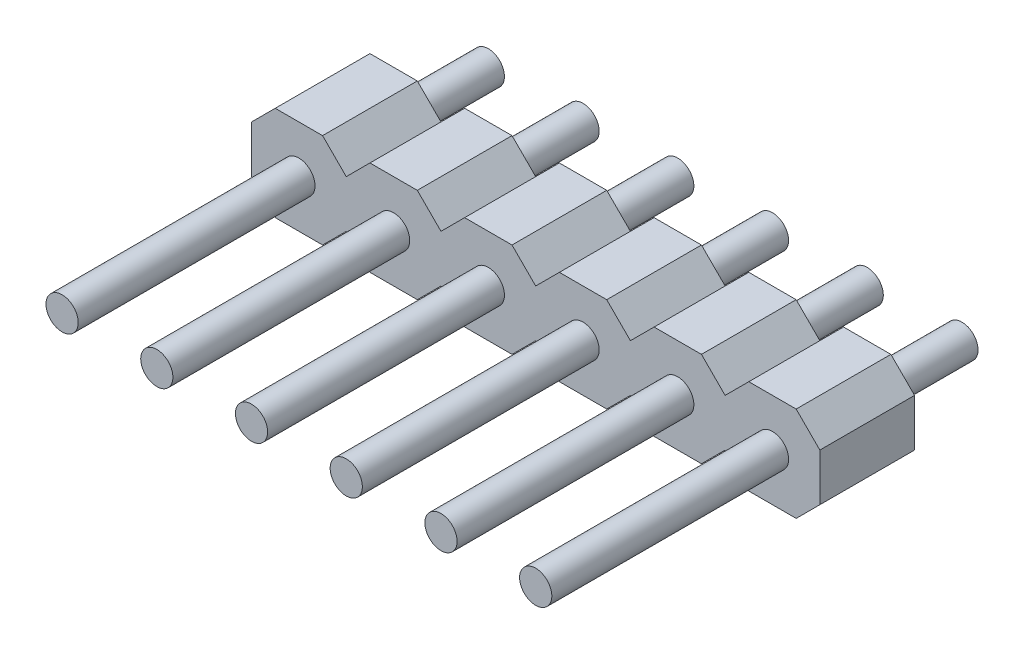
ISO-10303-21;
HEADER;
FILE_DESCRIPTION(('STEP AP214'),'2;1');
FILE_NAME('part.step','',(''),(''),'','','');
FILE_SCHEMA(('AUTOMOTIVE_DESIGN { 1 0 10303 214 1 1 1 1 }'));
ENDSEC;
DATA;
#1=APPLICATION_CONTEXT('core data for automotive mechanical design processes');
#2=APPLICATION_PROTOCOL_DEFINITION('international standard','automotive_design',2000,#1);
#3=PRODUCT_CONTEXT('',#1,'mechanical');
#4=PRODUCT('Part','Part','',(#3));
#5=PRODUCT_RELATED_PRODUCT_CATEGORY('part','',(#4));
#6=PRODUCT_DEFINITION_FORMATION('','',#4);
#7=PRODUCT_DEFINITION_CONTEXT('part definition',#1,'design');
#8=PRODUCT_DEFINITION('design','',#6,#7);
#9=PRODUCT_DEFINITION_SHAPE('','',#8);
#10=(LENGTH_UNIT() NAMED_UNIT(*) SI_UNIT(.MILLI.,.METRE.));
#11=(NAMED_UNIT(*) PLANE_ANGLE_UNIT() SI_UNIT($,.RADIAN.));
#12=(NAMED_UNIT(*) SI_UNIT($,.STERADIAN.) SOLID_ANGLE_UNIT());
#13=UNCERTAINTY_MEASURE_WITH_UNIT(LENGTH_MEASURE(1.E-05),#10,'distance_accuracy_value','');
#14=(GEOMETRIC_REPRESENTATION_CONTEXT(3) GLOBAL_UNCERTAINTY_ASSIGNED_CONTEXT((#13)) GLOBAL_UNIT_ASSIGNED_CONTEXT((#10,
#11,#12)) REPRESENTATION_CONTEXT('',''));
#15=CARTESIAN_POINT('',(0.,0.,0.));
#16=DIRECTION('',(0.,0.,1.));
#17=DIRECTION('',(1.,0.,0.));
#18=AXIS2_PLACEMENT_3D('',#15,#16,#17);
#19=CARTESIAN_POINT('',(12.7,0.,8.89));
#20=DIRECTION('',(0.,0.,-1.));
#21=DIRECTION('',(-1.,0.,0.));
#22=AXIS2_PLACEMENT_3D('',#19,#20,#21);
#23=CYLINDRICAL_SURFACE('',#22,0.4318);
#24=CARTESIAN_POINT('',(12.7,0.,8.89));
#25=DIRECTION('',(0.,0.,-1.));
#26=DIRECTION('',(-1.,0.,0.));
#27=AXIS2_PLACEMENT_3D('',#24,#25,#26);
#28=CIRCLE('',#27,0.4318);
#29=CARTESIAN_POINT('',(12.2682,0.,8.89));
#30=VERTEX_POINT('',#29);
#31=EDGE_CURVE('E11',#30,#30,#28,.T.);
#32=ORIENTED_EDGE('',*,*,#31,.T.);
#33=EDGE_LOOP('',(#32));
#34=FACE_BOUND('',#33,.T.);
#35=CARTESIAN_POINT('',(12.7,0.,-2.54));
#36=DIRECTION('',(0.,0.,-1.));
#37=DIRECTION('',(-1.,0.,0.));
#38=AXIS2_PLACEMENT_3D('',#35,#36,#37);
#39=CIRCLE('',#38,0.4318);
#40=CARTESIAN_POINT('',(12.2682,0.,-2.54));
#41=VERTEX_POINT('',#40);
#42=EDGE_CURVE('E46',#41,#41,#39,.T.);
#43=ORIENTED_EDGE('',*,*,#42,.F.);
#44=EDGE_LOOP('',(#43));
#45=FACE_BOUND('',#44,.T.);
#46=ADVANCED_FACE('F40',(#34,#45),#23,.T.);
#47=CARTESIAN_POINT('',(12.7,0.,8.89));
#48=DIRECTION('',(0.,0.,-1.));
#49=DIRECTION('',(-1.,0.,0.));
#50=AXIS2_PLACEMENT_3D('',#47,#48,#49);
#51=PLANE('',#50);
#52=ORIENTED_EDGE('',*,*,#31,.F.);
#53=EDGE_LOOP('',(#52));
#54=FACE_BOUND('',#53,.T.);
#55=ADVANCED_FACE('F55',(#54),#51,.F.);
#56=CARTESIAN_POINT('',(12.7,0.,-2.54));
#57=DIRECTION('',(0.,0.,-1.));
#58=DIRECTION('',(-1.,0.,0.));
#59=AXIS2_PLACEMENT_3D('',#56,#57,#58);
#60=PLANE('',#59);
#61=ORIENTED_EDGE('',*,*,#42,.T.);
#62=EDGE_LOOP('',(#61));
#63=FACE_BOUND('',#62,.T.);
#64=ADVANCED_FACE('F52',(#63),#60,.T.);
#65=CLOSED_SHELL('',(#46,#55,#64));
#66=MANIFOLD_SOLID_BREP('B2',#65);
#67=CARTESIAN_POINT('',(10.16,0.,8.89));
#68=DIRECTION('',(0.,0.,-1.));
#69=DIRECTION('',(-1.,0.,0.));
#70=AXIS2_PLACEMENT_3D('',#67,#68,#69);
#71=CYLINDRICAL_SURFACE('',#70,0.4318);
#72=CARTESIAN_POINT('',(10.16,0.,8.89));
#73=DIRECTION('',(0.,0.,-1.));
#74=DIRECTION('',(-1.,0.,0.));
#75=AXIS2_PLACEMENT_3D('',#72,#73,#74);
#76=CIRCLE('',#75,0.4318);
#77=CARTESIAN_POINT('',(9.7282,0.,8.89));
#78=VERTEX_POINT('',#77);
#79=EDGE_CURVE('E39',#78,#78,#76,.T.);
#80=ORIENTED_EDGE('',*,*,#79,.T.);
#81=EDGE_LOOP('',(#80));
#82=FACE_BOUND('',#81,.T.);
#83=CARTESIAN_POINT('',(10.16,0.,-2.54));
#84=DIRECTION('',(0.,0.,-1.));
#85=DIRECTION('',(-1.,0.,0.));
#86=AXIS2_PLACEMENT_3D('',#83,#84,#85);
#87=CIRCLE('',#86,0.4318);
#88=CARTESIAN_POINT('',(9.7282,0.,-2.54));
#89=VERTEX_POINT('',#88);
#90=EDGE_CURVE('E95',#89,#89,#87,.T.);
#91=ORIENTED_EDGE('',*,*,#90,.F.);
#92=EDGE_LOOP('',(#91));
#93=FACE_BOUND('',#92,.T.);
#94=ADVANCED_FACE('F89',(#82,#93),#71,.T.);
#95=CARTESIAN_POINT('',(10.16,0.,8.89));
#96=DIRECTION('',(0.,0.,-1.));
#97=DIRECTION('',(-1.,0.,0.));
#98=AXIS2_PLACEMENT_3D('',#95,#96,#97);
#99=PLANE('',#98);
#100=ORIENTED_EDGE('',*,*,#79,.F.);
#101=EDGE_LOOP('',(#100));
#102=FACE_BOUND('',#101,.T.);
#103=ADVANCED_FACE('F104',(#102),#99,.F.);
#104=CARTESIAN_POINT('',(10.16,0.,-2.54));
#105=DIRECTION('',(0.,0.,-1.));
#106=DIRECTION('',(-1.,0.,0.));
#107=AXIS2_PLACEMENT_3D('',#104,#105,#106);
#108=PLANE('',#107);
#109=ORIENTED_EDGE('',*,*,#90,.T.);
#110=EDGE_LOOP('',(#109));
#111=FACE_BOUND('',#110,.T.);
#112=ADVANCED_FACE('F101',(#111),#108,.T.);
#113=CLOSED_SHELL('',(#94,#103,#112));
#114=MANIFOLD_SOLID_BREP('B6',#113);
#115=CARTESIAN_POINT('',(7.62,0.,8.89));
#116=DIRECTION('',(0.,0.,-1.));
#117=DIRECTION('',(-1.,0.,0.));
#118=AXIS2_PLACEMENT_3D('',#115,#116,#117);
#119=CYLINDRICAL_SURFACE('',#118,0.4318);
#120=CARTESIAN_POINT('',(7.62,0.,8.89));
#121=DIRECTION('',(0.,0.,-1.));
#122=DIRECTION('',(-1.,0.,0.));
#123=AXIS2_PLACEMENT_3D('',#120,#121,#122);
#124=CIRCLE('',#123,0.4318);
#125=CARTESIAN_POINT('',(7.1882,0.,8.89));
#126=VERTEX_POINT('',#125);
#127=EDGE_CURVE('E88',#126,#126,#124,.T.);
#128=ORIENTED_EDGE('',*,*,#127,.T.);
#129=EDGE_LOOP('',(#128));
#130=FACE_BOUND('',#129,.T.);
#131=CARTESIAN_POINT('',(7.62,0.,-2.54));
#132=DIRECTION('',(0.,0.,-1.));
#133=DIRECTION('',(-1.,0.,0.));
#134=AXIS2_PLACEMENT_3D('',#131,#132,#133);
#135=CIRCLE('',#134,0.4318);
#136=CARTESIAN_POINT('',(7.1882,0.,-2.54));
#137=VERTEX_POINT('',#136);
#138=EDGE_CURVE('E144',#137,#137,#135,.T.);
#139=ORIENTED_EDGE('',*,*,#138,.F.);
#140=EDGE_LOOP('',(#139));
#141=FACE_BOUND('',#140,.T.);
#142=ADVANCED_FACE('F138',(#130,#141),#119,.T.);
#143=CARTESIAN_POINT('',(7.62,0.,8.89));
#144=DIRECTION('',(0.,0.,-1.));
#145=DIRECTION('',(-1.,0.,0.));
#146=AXIS2_PLACEMENT_3D('',#143,#144,#145);
#147=PLANE('',#146);
#148=ORIENTED_EDGE('',*,*,#127,.F.);
#149=EDGE_LOOP('',(#148));
#150=FACE_BOUND('',#149,.T.);
#151=ADVANCED_FACE('F153',(#150),#147,.F.);
#152=CARTESIAN_POINT('',(7.62,0.,-2.54));
#153=DIRECTION('',(0.,0.,-1.));
#154=DIRECTION('',(-1.,0.,0.));
#155=AXIS2_PLACEMENT_3D('',#152,#153,#154);
#156=PLANE('',#155);
#157=ORIENTED_EDGE('',*,*,#138,.T.);
#158=EDGE_LOOP('',(#157));
#159=FACE_BOUND('',#158,.T.);
#160=ADVANCED_FACE('F150',(#159),#156,.T.);
#161=CLOSED_SHELL('',(#142,#151,#160));
#162=MANIFOLD_SOLID_BREP('B34',#161);
#163=CARTESIAN_POINT('',(5.08,0.,8.89));
#164=DIRECTION('',(0.,0.,-1.));
#165=DIRECTION('',(-1.,0.,0.));
#166=AXIS2_PLACEMENT_3D('',#163,#164,#165);
#167=CYLINDRICAL_SURFACE('',#166,0.4318);
#168=CARTESIAN_POINT('',(5.08,0.,8.89));
#169=DIRECTION('',(0.,0.,-1.));
#170=DIRECTION('',(-1.,0.,0.));
#171=AXIS2_PLACEMENT_3D('',#168,#169,#170);
#172=CIRCLE('',#171,0.4318);
#173=CARTESIAN_POINT('',(4.6482,0.,8.89));
#174=VERTEX_POINT('',#173);
#175=EDGE_CURVE('E137',#174,#174,#172,.T.);
#176=ORIENTED_EDGE('',*,*,#175,.T.);
#177=EDGE_LOOP('',(#176));
#178=FACE_BOUND('',#177,.T.);
#179=CARTESIAN_POINT('',(5.08,0.,-2.54));
#180=DIRECTION('',(0.,0.,-1.));
#181=DIRECTION('',(-1.,0.,0.));
#182=AXIS2_PLACEMENT_3D('',#179,#180,#181);
#183=CIRCLE('',#182,0.4318);
#184=CARTESIAN_POINT('',(4.6482,0.,-2.54));
#185=VERTEX_POINT('',#184);
#186=EDGE_CURVE('E193',#185,#185,#183,.T.);
#187=ORIENTED_EDGE('',*,*,#186,.F.);
#188=EDGE_LOOP('',(#187));
#189=FACE_BOUND('',#188,.T.);
#190=ADVANCED_FACE('F187',(#178,#189),#167,.T.);
#191=CARTESIAN_POINT('',(5.08,0.,8.89));
#192=DIRECTION('',(0.,0.,-1.));
#193=DIRECTION('',(-1.,0.,0.));
#194=AXIS2_PLACEMENT_3D('',#191,#192,#193);
#195=PLANE('',#194);
#196=ORIENTED_EDGE('',*,*,#175,.F.);
#197=EDGE_LOOP('',(#196));
#198=FACE_BOUND('',#197,.T.);
#199=ADVANCED_FACE('F202',(#198),#195,.F.);
#200=CARTESIAN_POINT('',(5.08,0.,-2.54));
#201=DIRECTION('',(0.,0.,-1.));
#202=DIRECTION('',(-1.,0.,0.));
#203=AXIS2_PLACEMENT_3D('',#200,#201,#202);
#204=PLANE('',#203);
#205=ORIENTED_EDGE('',*,*,#186,.T.);
#206=EDGE_LOOP('',(#205));
#207=FACE_BOUND('',#206,.T.);
#208=ADVANCED_FACE('F199',(#207),#204,.T.);
#209=CLOSED_SHELL('',(#190,#199,#208));
#210=MANIFOLD_SOLID_BREP('B83',#209);
#211=CARTESIAN_POINT('',(2.54,0.,8.89));
#212=DIRECTION('',(0.,0.,-1.));
#213=DIRECTION('',(-1.,0.,0.));
#214=AXIS2_PLACEMENT_3D('',#211,#212,#213);
#215=CYLINDRICAL_SURFACE('',#214,0.4318);
#216=CARTESIAN_POINT('',(2.54,0.,8.89));
#217=DIRECTION('',(0.,0.,-1.));
#218=DIRECTION('',(-1.,0.,0.));
#219=AXIS2_PLACEMENT_3D('',#216,#217,#218);
#220=CIRCLE('',#219,0.4318);
#221=CARTESIAN_POINT('',(2.1082,0.,8.89));
#222=VERTEX_POINT('',#221);
#223=EDGE_CURVE('E186',#222,#222,#220,.T.);
#224=ORIENTED_EDGE('',*,*,#223,.T.);
#225=EDGE_LOOP('',(#224));
#226=FACE_BOUND('',#225,.T.);
#227=CARTESIAN_POINT('',(2.54,0.,-2.54));
#228=DIRECTION('',(0.,0.,-1.));
#229=DIRECTION('',(-1.,0.,0.));
#230=AXIS2_PLACEMENT_3D('',#227,#228,#229);
#231=CIRCLE('',#230,0.4318);
#232=CARTESIAN_POINT('',(2.1082,0.,-2.54));
#233=VERTEX_POINT('',#232);
#234=EDGE_CURVE('E242',#233,#233,#231,.T.);
#235=ORIENTED_EDGE('',*,*,#234,.F.);
#236=EDGE_LOOP('',(#235));
#237=FACE_BOUND('',#236,.T.);
#238=ADVANCED_FACE('F236',(#226,#237),#215,.T.);
#239=CARTESIAN_POINT('',(2.54,0.,8.89));
#240=DIRECTION('',(0.,0.,-1.));
#241=DIRECTION('',(-1.,0.,0.));
#242=AXIS2_PLACEMENT_3D('',#239,#240,#241);
#243=PLANE('',#242);
#244=ORIENTED_EDGE('',*,*,#223,.F.);
#245=EDGE_LOOP('',(#244));
#246=FACE_BOUND('',#245,.T.);
#247=ADVANCED_FACE('F251',(#246),#243,.F.);
#248=CARTESIAN_POINT('',(2.54,0.,-2.54));
#249=DIRECTION('',(0.,0.,-1.));
#250=DIRECTION('',(-1.,0.,0.));
#251=AXIS2_PLACEMENT_3D('',#248,#249,#250);
#252=PLANE('',#251);
#253=ORIENTED_EDGE('',*,*,#234,.T.);
#254=EDGE_LOOP('',(#253));
#255=FACE_BOUND('',#254,.T.);
#256=ADVANCED_FACE('F248',(#255),#252,.T.);
#257=CLOSED_SHELL('',(#238,#247,#256));
#258=MANIFOLD_SOLID_BREP('B132',#257);
#259=CARTESIAN_POINT('',(0.,0.,8.89));
#260=DIRECTION('',(0.,0.,-1.));
#261=DIRECTION('',(-1.,0.,0.));
#262=AXIS2_PLACEMENT_3D('',#259,#260,#261);
#263=CYLINDRICAL_SURFACE('',#262,0.4318);
#264=CARTESIAN_POINT('',(0.,0.,8.89));
#265=DIRECTION('',(0.,0.,-1.));
#266=DIRECTION('',(-1.,0.,0.));
#267=AXIS2_PLACEMENT_3D('',#264,#265,#266);
#268=CIRCLE('',#267,0.4318);
#269=CARTESIAN_POINT('',(-0.4318,0.,8.89));
#270=VERTEX_POINT('',#269);
#271=EDGE_CURVE('E235',#270,#270,#268,.T.);
#272=ORIENTED_EDGE('',*,*,#271,.T.);
#273=EDGE_LOOP('',(#272));
#274=FACE_BOUND('',#273,.T.);
#275=CARTESIAN_POINT('',(0.,0.,-2.54));
#276=DIRECTION('',(0.,0.,-1.));
#277=DIRECTION('',(-1.,0.,0.));
#278=AXIS2_PLACEMENT_3D('',#275,#276,#277);
#279=CIRCLE('',#278,0.4318);
#280=CARTESIAN_POINT('',(-0.4318,0.,-2.54));
#281=VERTEX_POINT('',#280);
#282=EDGE_CURVE('E292',#281,#281,#279,.T.);
#283=ORIENTED_EDGE('',*,*,#282,.F.);
#284=EDGE_LOOP('',(#283));
#285=FACE_BOUND('',#284,.T.);
#286=ADVANCED_FACE('F286',(#274,#285),#263,.T.);
#287=CARTESIAN_POINT('',(0.,0.,8.89));
#288=DIRECTION('',(0.,0.,-1.));
#289=DIRECTION('',(-1.,0.,0.));
#290=AXIS2_PLACEMENT_3D('',#287,#288,#289);
#291=PLANE('',#290);
#292=ORIENTED_EDGE('',*,*,#271,.F.);
#293=EDGE_LOOP('',(#292));
#294=FACE_BOUND('',#293,.T.);
#295=ADVANCED_FACE('F301',(#294),#291,.F.);
#296=CARTESIAN_POINT('',(0.,0.,-2.54));
#297=DIRECTION('',(0.,0.,-1.));
#298=DIRECTION('',(-1.,0.,0.));
#299=AXIS2_PLACEMENT_3D('',#296,#297,#298);
#300=PLANE('',#299);
#301=ORIENTED_EDGE('',*,*,#282,.T.);
#302=EDGE_LOOP('',(#301));
#303=FACE_BOUND('',#302,.T.);
#304=ADVANCED_FACE('F298',(#303),#300,.T.);
#305=CLOSED_SHELL('',(#286,#295,#304));
#306=MANIFOLD_SOLID_BREP('B181',#305);
#307=CARTESIAN_POINT('',(-0.635,1.27,2.54));
#308=DIRECTION('',(0.707106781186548,-0.707106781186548,0.));
#309=DIRECTION('',(0.707106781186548,0.707106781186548,0.));
#310=AXIS2_PLACEMENT_3D('',#307,#308,#309);
#311=PLANE('',#310);
#312=DIRECTION('',(-0.707106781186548,-0.707106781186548,0.));
#313=VECTOR('',#312,1.);
#314=CARTESIAN_POINT('',(-0.635,1.27,0.));
#315=LINE('',#314,#313);
#316=CARTESIAN_POINT('',(-0.635,1.27,0.));
#317=VERTEX_POINT('',#316);
#318=CARTESIAN_POINT('',(-1.27,0.635,0.));
#319=VERTEX_POINT('',#318);
#320=EDGE_CURVE('E603',#317,#319,#315,.T.);
#321=ORIENTED_EDGE('',*,*,#320,.T.);
#322=DIRECTION('',(0.,0.,-1.));
#323=VECTOR('',#322,1.);
#324=CARTESIAN_POINT('',(-1.27,0.635,2.54));
#325=LINE('',#324,#323);
#326=CARTESIAN_POINT('',(-1.27,0.635,2.54));
#327=VERTEX_POINT('',#326);
#328=EDGE_CURVE('E284',#327,#319,#325,.T.);
#329=ORIENTED_EDGE('',*,*,#328,.F.);
#330=DIRECTION('',(-0.707106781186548,-0.707106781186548,0.));
#331=VECTOR('',#330,1.);
#332=CARTESIAN_POINT('',(-0.635,1.27,2.54));
#333=LINE('',#332,#331);
#334=CARTESIAN_POINT('',(-0.635,1.27,2.54));
#335=VERTEX_POINT('',#334);
#336=EDGE_CURVE('E677',#335,#327,#333,.T.);
#337=ORIENTED_EDGE('',*,*,#336,.F.);
#338=DIRECTION('',(0.,0.,-1.));
#339=VECTOR('',#338,1.);
#340=CARTESIAN_POINT('',(-0.635,1.27,2.54));
#341=LINE('',#340,#339);
#342=EDGE_CURVE('E599',#335,#317,#341,.T.);
#343=ORIENTED_EDGE('',*,*,#342,.T.);
#344=EDGE_LOOP('',(#321,#329,#337,#343));
#345=FACE_BOUND('',#344,.T.);
#346=ADVANCED_FACE('F327',(#345),#311,.F.);
#347=CARTESIAN_POINT('',(-1.27,0.635,2.54));
#348=DIRECTION('',(1.,0.,0.));
#349=DIRECTION('',(0.,0.,-1.));
#350=AXIS2_PLACEMENT_3D('',#347,#348,#349);
#351=PLANE('',#350);
#352=DIRECTION('',(0.,-1.,0.));
#353=VECTOR('',#352,1.);
#354=CARTESIAN_POINT('',(-1.27,0.635,0.));
#355=LINE('',#354,#353);
#356=CARTESIAN_POINT('',(-1.27,-0.635,0.));
#357=VERTEX_POINT('',#356);
#358=EDGE_CURVE('E606',#319,#357,#355,.T.);
#359=ORIENTED_EDGE('',*,*,#358,.T.);
#360=DIRECTION('',(0.,0.,-1.));
#361=VECTOR('',#360,1.);
#362=CARTESIAN_POINT('',(-1.27,-0.635,2.54));
#363=LINE('',#362,#361);
#364=CARTESIAN_POINT('',(-1.27,-0.635,2.54));
#365=VERTEX_POINT('',#364);
#366=EDGE_CURVE('E335',#365,#357,#363,.T.);
#367=ORIENTED_EDGE('',*,*,#366,.F.);
#368=DIRECTION('',(0.,-1.,0.));
#369=VECTOR('',#368,1.);
#370=CARTESIAN_POINT('',(-1.27,0.635,2.54));
#371=LINE('',#370,#369);
#372=EDGE_CURVE('E476',#327,#365,#371,.T.);
#373=ORIENTED_EDGE('',*,*,#372,.F.);
#374=ORIENTED_EDGE('',*,*,#328,.T.);
#375=EDGE_LOOP('',(#359,#367,#373,#374));
#376=FACE_BOUND('',#375,.T.);
#377=ADVANCED_FACE('F885',(#376),#351,.F.);
#378=CARTESIAN_POINT('',(-1.27,-0.635,2.54));
#379=DIRECTION('',(0.707106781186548,0.707106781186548,0.));
#380=DIRECTION('',(-0.707106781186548,0.707106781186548,0.));
#381=AXIS2_PLACEMENT_3D('',#378,#379,#380);
#382=PLANE('',#381);
#383=DIRECTION('',(0.707106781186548,-0.707106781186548,0.));
#384=VECTOR('',#383,1.);
#385=CARTESIAN_POINT('',(-1.27,-0.635,0.));
#386=LINE('',#385,#384);
#387=CARTESIAN_POINT('',(-0.635,-1.27,0.));
#388=VERTEX_POINT('',#387);
#389=EDGE_CURVE('E608',#357,#388,#386,.T.);
#390=ORIENTED_EDGE('',*,*,#389,.T.);
#391=DIRECTION('',(0.,0.,-1.));
#392=VECTOR('',#391,1.);
#393=CARTESIAN_POINT('',(-0.635,-1.27,2.54));
#394=LINE('',#393,#392);
#395=CARTESIAN_POINT('',(-0.635,-1.27,2.54));
#396=VERTEX_POINT('',#395);
#397=EDGE_CURVE('E774',#396,#388,#394,.T.);
#398=ORIENTED_EDGE('',*,*,#397,.F.);
#399=DIRECTION('',(0.707106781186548,-0.707106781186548,0.));
#400=VECTOR('',#399,1.);
#401=CARTESIAN_POINT('',(-1.27,-0.635,2.54));
#402=LINE('',#401,#400);
#403=EDGE_CURVE('E782',#365,#396,#402,.T.);
#404=ORIENTED_EDGE('',*,*,#403,.F.);
#405=ORIENTED_EDGE('',*,*,#366,.T.);
#406=EDGE_LOOP('',(#390,#398,#404,#405));
#407=FACE_BOUND('',#406,.T.);
#408=ADVANCED_FACE('F780',(#407),#382,.F.);
#409=CARTESIAN_POINT('',(0.634999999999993,-1.27,2.54));
#410=DIRECTION('',(0.,1.,0.));
#411=DIRECTION('',(0.,0.,1.));
#412=AXIS2_PLACEMENT_3D('',#409,#410,#411);
#413=PLANE('',#412);
#414=DIRECTION('',(1.,0.,0.));
#415=VECTOR('',#414,1.);
#416=CARTESIAN_POINT('',(0.634999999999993,-1.27,0.));
#417=LINE('',#416,#415);
#418=CARTESIAN_POINT('',(0.634999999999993,-1.27,0.));
#419=VERTEX_POINT('',#418);
#420=EDGE_CURVE('E610',#388,#419,#417,.T.);
#421=ORIENTED_EDGE('',*,*,#420,.T.);
#422=DIRECTION('',(0.,0.,-1.));
#423=VECTOR('',#422,1.);
#424=CARTESIAN_POINT('',(0.634999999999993,-1.27,2.54));
#425=LINE('',#424,#423);
#426=CARTESIAN_POINT('',(0.634999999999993,-1.27,2.54));
#427=VERTEX_POINT('',#426);
#428=EDGE_CURVE('E771',#427,#419,#425,.T.);
#429=ORIENTED_EDGE('',*,*,#428,.F.);
#430=DIRECTION('',(1.,0.,0.));
#431=VECTOR('',#430,1.);
#432=CARTESIAN_POINT('',(0.634999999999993,-1.27,2.54));
#433=LINE('',#432,#431);
#434=EDGE_CURVE('E800',#396,#427,#433,.T.);
#435=ORIENTED_EDGE('',*,*,#434,.F.);
#436=ORIENTED_EDGE('',*,*,#397,.T.);
#437=EDGE_LOOP('',(#421,#429,#435,#436));
#438=FACE_BOUND('',#437,.T.);
#439=ADVANCED_FACE('F791',(#438),#413,.F.);
#440=CARTESIAN_POINT('',(1.27000000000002,-0.634999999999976,2.54));
#441=DIRECTION('',(-0.707106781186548,0.707106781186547,0.));
#442=DIRECTION('',(-0.707106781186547,-0.707106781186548,0.));
#443=AXIS2_PLACEMENT_3D('',#440,#441,#442);
#444=PLANE('',#443);
#445=DIRECTION('',(0.707106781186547,0.707106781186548,0.));
#446=VECTOR('',#445,1.);
#447=CARTESIAN_POINT('',(1.27000000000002,-0.634999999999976,0.));
#448=LINE('',#447,#446);
#449=CARTESIAN_POINT('',(1.27000000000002,-0.634999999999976,0.));
#450=VERTEX_POINT('',#449);
#451=EDGE_CURVE('E612',#419,#450,#448,.T.);
#452=ORIENTED_EDGE('',*,*,#451,.T.);
#453=DIRECTION('',(0.,0.,-1.));
#454=VECTOR('',#453,1.);
#455=CARTESIAN_POINT('',(1.27000000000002,-0.634999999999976,2.54));
#456=LINE('',#455,#454);
#457=CARTESIAN_POINT('',(1.27000000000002,-0.634999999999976,2.54));
#458=VERTEX_POINT('',#457);
#459=EDGE_CURVE('E768',#458,#450,#456,.T.);
#460=ORIENTED_EDGE('',*,*,#459,.F.);
#461=DIRECTION('',(0.707106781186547,0.707106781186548,0.));
#462=VECTOR('',#461,1.);
#463=CARTESIAN_POINT('',(1.27000000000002,-0.634999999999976,2.54));
#464=LINE('',#463,#462);
#465=EDGE_CURVE('E797',#427,#458,#464,.T.);
#466=ORIENTED_EDGE('',*,*,#465,.F.);
#467=ORIENTED_EDGE('',*,*,#428,.T.);
#468=EDGE_LOOP('',(#452,#460,#466,#467));
#469=FACE_BOUND('',#468,.T.);
#470=ADVANCED_FACE('F795',(#469),#444,.F.);
#471=CARTESIAN_POINT('',(1.90499999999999,-1.26999999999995,2.54));
#472=DIRECTION('',(0.707106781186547,0.707106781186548,0.));
#473=DIRECTION('',(-0.707106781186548,0.707106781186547,0.));
#474=AXIS2_PLACEMENT_3D('',#471,#472,#473);
#475=PLANE('',#474);
#476=DIRECTION('',(0.707106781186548,-0.707106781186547,0.));
#477=VECTOR('',#476,1.);
#478=CARTESIAN_POINT('',(1.90499999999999,-1.26999999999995,0.));
#479=LINE('',#478,#477);
#480=CARTESIAN_POINT('',(1.90499999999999,-1.26999999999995,0.));
#481=VERTEX_POINT('',#480);
#482=EDGE_CURVE('E614',#450,#481,#479,.T.);
#483=ORIENTED_EDGE('',*,*,#482,.T.);
#484=DIRECTION('',(0.,0.,-1.));
#485=VECTOR('',#484,1.);
#486=CARTESIAN_POINT('',(1.90499999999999,-1.26999999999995,2.54));
#487=LINE('',#486,#485);
#488=CARTESIAN_POINT('',(1.90499999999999,-1.26999999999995,2.54));
#489=VERTEX_POINT('',#488);
#490=EDGE_CURVE('E765',#489,#481,#487,.T.);
#491=ORIENTED_EDGE('',*,*,#490,.F.);
#492=DIRECTION('',(0.707106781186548,-0.707106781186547,0.));
#493=VECTOR('',#492,1.);
#494=CARTESIAN_POINT('',(1.90499999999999,-1.26999999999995,2.54));
#495=LINE('',#494,#493);
#496=EDGE_CURVE('E799',#458,#489,#495,.T.);
#497=ORIENTED_EDGE('',*,*,#496,.F.);
#498=ORIENTED_EDGE('',*,*,#459,.T.);
#499=EDGE_LOOP('',(#483,#491,#497,#498));
#500=FACE_BOUND('',#499,.T.);
#501=ADVANCED_FACE('F898',(#500),#475,.F.);
#502=CARTESIAN_POINT('',(3.17499999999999,-1.26999999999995,2.54));
#503=DIRECTION('',(0.,1.,0.));
#504=DIRECTION('',(0.,0.,1.));
#505=AXIS2_PLACEMENT_3D('',#502,#503,#504);
#506=PLANE('',#505);
#507=DIRECTION('',(1.,0.,0.));
#508=VECTOR('',#507,1.);
#509=CARTESIAN_POINT('',(3.17499999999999,-1.26999999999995,0.));
#510=LINE('',#509,#508);
#511=CARTESIAN_POINT('',(3.17499999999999,-1.26999999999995,0.));
#512=VERTEX_POINT('',#511);
#513=EDGE_CURVE('E616',#481,#512,#510,.T.);
#514=ORIENTED_EDGE('',*,*,#513,.T.);
#515=DIRECTION('',(0.,0.,-1.));
#516=VECTOR('',#515,1.);
#517=CARTESIAN_POINT('',(3.17499999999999,-1.26999999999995,2.54));
#518=LINE('',#517,#516);
#519=CARTESIAN_POINT('',(3.17499999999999,-1.26999999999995,2.54));
#520=VERTEX_POINT('',#519);
#521=EDGE_CURVE('E762',#520,#512,#518,.T.);
#522=ORIENTED_EDGE('',*,*,#521,.F.);
#523=DIRECTION('',(1.,0.,0.));
#524=VECTOR('',#523,1.);
#525=CARTESIAN_POINT('',(3.17499999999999,-1.26999999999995,2.54));
#526=LINE('',#525,#524);
#527=EDGE_CURVE('E802',#489,#520,#526,.T.);
#528=ORIENTED_EDGE('',*,*,#527,.F.);
#529=ORIENTED_EDGE('',*,*,#490,.T.);
#530=EDGE_LOOP('',(#514,#522,#528,#529));
#531=FACE_BOUND('',#530,.T.);
#532=ADVANCED_FACE('F901',(#531),#506,.F.);
#533=CARTESIAN_POINT('',(3.81000000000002,-0.634999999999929,2.54));
#534=DIRECTION('',(-0.707106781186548,0.707106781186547,0.));
#535=DIRECTION('',(-0.707106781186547,-0.707106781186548,0.));
#536=AXIS2_PLACEMENT_3D('',#533,#534,#535);
#537=PLANE('',#536);
#538=DIRECTION('',(0.707106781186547,0.707106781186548,0.));
#539=VECTOR('',#538,1.);
#540=CARTESIAN_POINT('',(3.81000000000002,-0.634999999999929,0.));
#541=LINE('',#540,#539);
#542=CARTESIAN_POINT('',(3.81000000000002,-0.634999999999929,0.));
#543=VERTEX_POINT('',#542);
#544=EDGE_CURVE('E618',#512,#543,#541,.T.);
#545=ORIENTED_EDGE('',*,*,#544,.T.);
#546=DIRECTION('',(0.,0.,-1.));
#547=VECTOR('',#546,1.);
#548=CARTESIAN_POINT('',(3.81000000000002,-0.634999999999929,2.54));
#549=LINE('',#548,#547);
#550=CARTESIAN_POINT('',(3.81000000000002,-0.634999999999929,2.54));
#551=VERTEX_POINT('',#550);
#552=EDGE_CURVE('E759',#551,#543,#549,.T.);
#553=ORIENTED_EDGE('',*,*,#552,.F.);
#554=DIRECTION('',(0.707106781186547,0.707106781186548,0.));
#555=VECTOR('',#554,1.);
#556=CARTESIAN_POINT('',(3.81000000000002,-0.634999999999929,2.54));
#557=LINE('',#556,#555);
#558=EDGE_CURVE('E808',#520,#551,#557,.T.);
#559=ORIENTED_EDGE('',*,*,#558,.F.);
#560=ORIENTED_EDGE('',*,*,#521,.T.);
#561=EDGE_LOOP('',(#545,#553,#559,#560));
#562=FACE_BOUND('',#561,.T.);
#563=ADVANCED_FACE('F905',(#562),#537,.F.);
#564=CARTESIAN_POINT('',(4.44499999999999,-1.2699999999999,2.54));
#565=DIRECTION('',(0.707106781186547,0.707106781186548,0.));
#566=DIRECTION('',(-0.707106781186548,0.707106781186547,0.));
#567=AXIS2_PLACEMENT_3D('',#564,#565,#566);
#568=PLANE('',#567);
#569=DIRECTION('',(0.707106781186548,-0.707106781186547,0.));
#570=VECTOR('',#569,1.);
#571=CARTESIAN_POINT('',(4.44499999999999,-1.2699999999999,0.));
#572=LINE('',#571,#570);
#573=CARTESIAN_POINT('',(4.44499999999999,-1.2699999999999,0.));
#574=VERTEX_POINT('',#573);
#575=EDGE_CURVE('E620',#543,#574,#572,.T.);
#576=ORIENTED_EDGE('',*,*,#575,.T.);
#577=DIRECTION('',(0.,0.,-1.));
#578=VECTOR('',#577,1.);
#579=CARTESIAN_POINT('',(4.44499999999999,-1.2699999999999,2.54));
#580=LINE('',#579,#578);
#581=CARTESIAN_POINT('',(4.44499999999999,-1.2699999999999,2.54));
#582=VERTEX_POINT('',#581);
#583=EDGE_CURVE('E756',#582,#574,#580,.T.);
#584=ORIENTED_EDGE('',*,*,#583,.F.);
#585=DIRECTION('',(0.707106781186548,-0.707106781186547,0.));
#586=VECTOR('',#585,1.);
#587=CARTESIAN_POINT('',(4.44499999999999,-1.2699999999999,2.54));
#588=LINE('',#587,#586);
#589=EDGE_CURVE('E810',#551,#582,#588,.T.);
#590=ORIENTED_EDGE('',*,*,#589,.F.);
#591=ORIENTED_EDGE('',*,*,#552,.T.);
#592=EDGE_LOOP('',(#576,#584,#590,#591));
#593=FACE_BOUND('',#592,.T.);
#594=ADVANCED_FACE('F909',(#593),#568,.F.);
#595=CARTESIAN_POINT('',(5.71499999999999,-1.2699999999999,2.54));
#596=DIRECTION('',(0.,1.,0.));
#597=DIRECTION('',(0.,0.,1.));
#598=AXIS2_PLACEMENT_3D('',#595,#596,#597);
#599=PLANE('',#598);
#600=DIRECTION('',(1.,0.,0.));
#601=VECTOR('',#600,1.);
#602=CARTESIAN_POINT('',(5.71499999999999,-1.2699999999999,0.));
#603=LINE('',#602,#601);
#604=CARTESIAN_POINT('',(5.71499999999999,-1.2699999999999,0.));
#605=VERTEX_POINT('',#604);
#606=EDGE_CURVE('E622',#574,#605,#603,.T.);
#607=ORIENTED_EDGE('',*,*,#606,.T.);
#608=DIRECTION('',(0.,0.,-1.));
#609=VECTOR('',#608,1.);
#610=CARTESIAN_POINT('',(5.71499999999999,-1.2699999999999,2.54));
#611=LINE('',#610,#609);
#612=CARTESIAN_POINT('',(5.71499999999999,-1.2699999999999,2.54));
#613=VERTEX_POINT('',#612);
#614=EDGE_CURVE('E753',#613,#605,#611,.T.);
#615=ORIENTED_EDGE('',*,*,#614,.F.);
#616=DIRECTION('',(1.,0.,0.));
#617=VECTOR('',#616,1.);
#618=CARTESIAN_POINT('',(5.71499999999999,-1.2699999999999,2.54));
#619=LINE('',#618,#617);
#620=EDGE_CURVE('E812',#582,#613,#619,.T.);
#621=ORIENTED_EDGE('',*,*,#620,.F.);
#622=ORIENTED_EDGE('',*,*,#583,.T.);
#623=EDGE_LOOP('',(#607,#615,#621,#622));
#624=FACE_BOUND('',#623,.T.);
#625=ADVANCED_FACE('F913',(#624),#599,.F.);
#626=CARTESIAN_POINT('',(6.35000000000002,-0.634999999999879,2.54));
#627=DIRECTION('',(-0.707106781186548,0.707106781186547,0.));
#628=DIRECTION('',(-0.707106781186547,-0.707106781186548,0.));
#629=AXIS2_PLACEMENT_3D('',#626,#627,#628);
#630=PLANE('',#629);
#631=DIRECTION('',(0.707106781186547,0.707106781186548,0.));
#632=VECTOR('',#631,1.);
#633=CARTESIAN_POINT('',(6.35000000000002,-0.634999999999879,0.));
#634=LINE('',#633,#632);
#635=CARTESIAN_POINT('',(6.35000000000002,-0.634999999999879,0.));
#636=VERTEX_POINT('',#635);
#637=EDGE_CURVE('E624',#605,#636,#634,.T.);
#638=ORIENTED_EDGE('',*,*,#637,.T.);
#639=DIRECTION('',(0.,0.,-1.));
#640=VECTOR('',#639,1.);
#641=CARTESIAN_POINT('',(6.35000000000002,-0.634999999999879,2.54));
#642=LINE('',#641,#640);
#643=CARTESIAN_POINT('',(6.35000000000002,-0.634999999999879,2.54));
#644=VERTEX_POINT('',#643);
#645=EDGE_CURVE('E750',#644,#636,#642,.T.);
#646=ORIENTED_EDGE('',*,*,#645,.F.);
#647=DIRECTION('',(0.707106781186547,0.707106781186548,0.));
#648=VECTOR('',#647,1.);
#649=CARTESIAN_POINT('',(6.35000000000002,-0.634999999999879,2.54));
#650=LINE('',#649,#648);
#651=EDGE_CURVE('E814',#613,#644,#650,.T.);
#652=ORIENTED_EDGE('',*,*,#651,.F.);
#653=ORIENTED_EDGE('',*,*,#614,.T.);
#654=EDGE_LOOP('',(#638,#646,#652,#653));
#655=FACE_BOUND('',#654,.T.);
#656=ADVANCED_FACE('F917',(#655),#630,.F.);
#657=CARTESIAN_POINT('',(6.98499999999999,-1.26999999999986,2.54));
#658=DIRECTION('',(0.707106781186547,0.707106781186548,0.));
#659=DIRECTION('',(-0.707106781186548,0.707106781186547,0.));
#660=AXIS2_PLACEMENT_3D('',#657,#658,#659);
#661=PLANE('',#660);
#662=DIRECTION('',(0.707106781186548,-0.707106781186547,0.));
#663=VECTOR('',#662,1.);
#664=CARTESIAN_POINT('',(6.98499999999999,-1.26999999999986,0.));
#665=LINE('',#664,#663);
#666=CARTESIAN_POINT('',(6.98499999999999,-1.26999999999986,0.));
#667=VERTEX_POINT('',#666);
#668=EDGE_CURVE('E626',#636,#667,#665,.T.);
#669=ORIENTED_EDGE('',*,*,#668,.T.);
#670=DIRECTION('',(0.,0.,-1.));
#671=VECTOR('',#670,1.);
#672=CARTESIAN_POINT('',(6.98499999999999,-1.26999999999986,2.54));
#673=LINE('',#672,#671);
#674=CARTESIAN_POINT('',(6.98499999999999,-1.26999999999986,2.54));
#675=VERTEX_POINT('',#674);
#676=EDGE_CURVE('E747',#675,#667,#673,.T.);
#677=ORIENTED_EDGE('',*,*,#676,.F.);
#678=DIRECTION('',(0.707106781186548,-0.707106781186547,0.));
#679=VECTOR('',#678,1.);
#680=CARTESIAN_POINT('',(6.98499999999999,-1.26999999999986,2.54));
#681=LINE('',#680,#679);
#682=EDGE_CURVE('E816',#644,#675,#681,.T.);
#683=ORIENTED_EDGE('',*,*,#682,.F.);
#684=ORIENTED_EDGE('',*,*,#645,.T.);
#685=EDGE_LOOP('',(#669,#677,#683,#684));
#686=FACE_BOUND('',#685,.T.);
#687=ADVANCED_FACE('F921',(#686),#661,.F.);
#688=CARTESIAN_POINT('',(8.25499999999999,-1.26999999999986,2.54));
#689=DIRECTION('',(0.,1.,0.));
#690=DIRECTION('',(-1.,0.,0.));
#691=AXIS2_PLACEMENT_3D('',#688,#689,#690);
#692=PLANE('',#691);
#693=DIRECTION('',(1.,0.,0.));
#694=VECTOR('',#693,1.);
#695=CARTESIAN_POINT('',(8.25499999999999,-1.26999999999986,0.));
#696=LINE('',#695,#694);
#697=CARTESIAN_POINT('',(8.25499999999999,-1.26999999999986,0.));
#698=VERTEX_POINT('',#697);
#699=EDGE_CURVE('E628',#667,#698,#696,.T.);
#700=ORIENTED_EDGE('',*,*,#699,.T.);
#701=DIRECTION('',(0.,0.,-1.));
#702=VECTOR('',#701,1.);
#703=CARTESIAN_POINT('',(8.25499999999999,-1.26999999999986,2.54));
#704=LINE('',#703,#702);
#705=CARTESIAN_POINT('',(8.25499999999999,-1.26999999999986,2.54));
#706=VERTEX_POINT('',#705);
#707=EDGE_CURVE('E744',#706,#698,#704,.T.);
#708=ORIENTED_EDGE('',*,*,#707,.F.);
#709=DIRECTION('',(1.,0.,0.));
#710=VECTOR('',#709,1.);
#711=CARTESIAN_POINT('',(8.25499999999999,-1.26999999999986,2.54));
#712=LINE('',#711,#710);
#713=EDGE_CURVE('E818',#675,#706,#712,.T.);
#714=ORIENTED_EDGE('',*,*,#713,.F.);
#715=ORIENTED_EDGE('',*,*,#676,.T.);
#716=EDGE_LOOP('',(#700,#708,#714,#715));
#717=FACE_BOUND('',#716,.T.);
#718=ADVANCED_FACE('F925',(#717),#692,.F.);
#719=CARTESIAN_POINT('',(8.89000000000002,-0.634999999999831,2.54));
#720=DIRECTION('',(-0.707106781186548,0.707106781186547,0.));
#721=DIRECTION('',(-0.707106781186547,-0.707106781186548,0.));
#722=AXIS2_PLACEMENT_3D('',#719,#720,#721);
#723=PLANE('',#722);
#724=DIRECTION('',(0.707106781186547,0.707106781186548,0.));
#725=VECTOR('',#724,1.);
#726=CARTESIAN_POINT('',(8.89000000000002,-0.634999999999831,0.));
#727=LINE('',#726,#725);
#728=CARTESIAN_POINT('',(8.89000000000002,-0.634999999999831,0.));
#729=VERTEX_POINT('',#728);
#730=EDGE_CURVE('E630',#698,#729,#727,.T.);
#731=ORIENTED_EDGE('',*,*,#730,.T.);
#732=DIRECTION('',(0.,0.,-1.));
#733=VECTOR('',#732,1.);
#734=CARTESIAN_POINT('',(8.89000000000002,-0.634999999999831,2.54));
#735=LINE('',#734,#733);
#736=CARTESIAN_POINT('',(8.89000000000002,-0.634999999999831,2.54));
#737=VERTEX_POINT('',#736);
#738=EDGE_CURVE('E741',#737,#729,#735,.T.);
#739=ORIENTED_EDGE('',*,*,#738,.F.);
#740=DIRECTION('',(0.707106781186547,0.707106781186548,0.));
#741=VECTOR('',#740,1.);
#742=CARTESIAN_POINT('',(8.89000000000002,-0.634999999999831,2.54));
#743=LINE('',#742,#741);
#744=EDGE_CURVE('E820',#706,#737,#743,.T.);
#745=ORIENTED_EDGE('',*,*,#744,.F.);
#746=ORIENTED_EDGE('',*,*,#707,.T.);
#747=EDGE_LOOP('',(#731,#739,#745,#746));
#748=FACE_BOUND('',#747,.T.);
#749=ADVANCED_FACE('F929',(#748),#723,.F.);
#750=CARTESIAN_POINT('',(9.52499999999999,-1.26999999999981,2.54));
#751=DIRECTION('',(0.707106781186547,0.707106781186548,0.));
#752=DIRECTION('',(-0.707106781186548,0.707106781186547,0.));
#753=AXIS2_PLACEMENT_3D('',#750,#751,#752);
#754=PLANE('',#753);
#755=DIRECTION('',(0.707106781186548,-0.707106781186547,0.));
#756=VECTOR('',#755,1.);
#757=CARTESIAN_POINT('',(9.52499999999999,-1.26999999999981,0.));
#758=LINE('',#757,#756);
#759=CARTESIAN_POINT('',(9.52499999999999,-1.26999999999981,0.));
#760=VERTEX_POINT('',#759);
#761=EDGE_CURVE('E632',#729,#760,#758,.T.);
#762=ORIENTED_EDGE('',*,*,#761,.T.);
#763=DIRECTION('',(0.,0.,-1.));
#764=VECTOR('',#763,1.);
#765=CARTESIAN_POINT('',(9.52499999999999,-1.26999999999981,2.54));
#766=LINE('',#765,#764);
#767=CARTESIAN_POINT('',(9.52499999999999,-1.26999999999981,2.54));
#768=VERTEX_POINT('',#767);
#769=EDGE_CURVE('E738',#768,#760,#766,.T.);
#770=ORIENTED_EDGE('',*,*,#769,.F.);
#771=DIRECTION('',(0.707106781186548,-0.707106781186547,0.));
#772=VECTOR('',#771,1.);
#773=CARTESIAN_POINT('',(9.52499999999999,-1.26999999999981,2.54));
#774=LINE('',#773,#772);
#775=EDGE_CURVE('E822',#737,#768,#774,.T.);
#776=ORIENTED_EDGE('',*,*,#775,.F.);
#777=ORIENTED_EDGE('',*,*,#738,.T.);
#778=EDGE_LOOP('',(#762,#770,#776,#777));
#779=FACE_BOUND('',#778,.T.);
#780=ADVANCED_FACE('F933',(#779),#754,.F.);
#781=CARTESIAN_POINT('',(10.795,-1.26999999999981,2.54));
#782=DIRECTION('',(0.,1.,0.));
#783=DIRECTION('',(-1.,0.,0.));
#784=AXIS2_PLACEMENT_3D('',#781,#782,#783);
#785=PLANE('',#784);
#786=DIRECTION('',(1.,0.,0.));
#787=VECTOR('',#786,1.);
#788=CARTESIAN_POINT('',(10.795,-1.26999999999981,0.));
#789=LINE('',#788,#787);
#790=CARTESIAN_POINT('',(10.795,-1.26999999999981,0.));
#791=VERTEX_POINT('',#790);
#792=EDGE_CURVE('E634',#760,#791,#789,.T.);
#793=ORIENTED_EDGE('',*,*,#792,.T.);
#794=DIRECTION('',(0.,0.,-1.));
#795=VECTOR('',#794,1.);
#796=CARTESIAN_POINT('',(10.795,-1.26999999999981,2.54));
#797=LINE('',#796,#795);
#798=CARTESIAN_POINT('',(10.795,-1.26999999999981,2.54));
#799=VERTEX_POINT('',#798);
#800=EDGE_CURVE('E735',#799,#791,#797,.T.);
#801=ORIENTED_EDGE('',*,*,#800,.F.);
#802=DIRECTION('',(1.,0.,0.));
#803=VECTOR('',#802,1.);
#804=CARTESIAN_POINT('',(10.795,-1.26999999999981,2.54));
#805=LINE('',#804,#803);
#806=EDGE_CURVE('E824',#768,#799,#805,.T.);
#807=ORIENTED_EDGE('',*,*,#806,.F.);
#808=ORIENTED_EDGE('',*,*,#769,.T.);
#809=EDGE_LOOP('',(#793,#801,#807,#808));
#810=FACE_BOUND('',#809,.T.);
#811=ADVANCED_FACE('F937',(#810),#785,.F.);
#812=CARTESIAN_POINT('',(11.43,-0.634999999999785,2.54));
#813=DIRECTION('',(-0.707106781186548,0.707106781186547,0.));
#814=DIRECTION('',(-0.707106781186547,-0.707106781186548,0.));
#815=AXIS2_PLACEMENT_3D('',#812,#813,#814);
#816=PLANE('',#815);
#817=DIRECTION('',(0.707106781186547,0.707106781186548,0.));
#818=VECTOR('',#817,1.);
#819=CARTESIAN_POINT('',(11.43,-0.634999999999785,0.));
#820=LINE('',#819,#818);
#821=CARTESIAN_POINT('',(11.43,-0.634999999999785,0.));
#822=VERTEX_POINT('',#821);
#823=EDGE_CURVE('E636',#791,#822,#820,.T.);
#824=ORIENTED_EDGE('',*,*,#823,.T.);
#825=DIRECTION('',(0.,0.,-1.));
#826=VECTOR('',#825,1.);
#827=CARTESIAN_POINT('',(11.43,-0.634999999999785,2.54));
#828=LINE('',#827,#826);
#829=CARTESIAN_POINT('',(11.43,-0.634999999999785,2.54));
#830=VERTEX_POINT('',#829);
#831=EDGE_CURVE('E732',#830,#822,#828,.T.);
#832=ORIENTED_EDGE('',*,*,#831,.F.);
#833=DIRECTION('',(0.707106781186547,0.707106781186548,0.));
#834=VECTOR('',#833,1.);
#835=CARTESIAN_POINT('',(11.43,-0.634999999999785,2.54));
#836=LINE('',#835,#834);
#837=EDGE_CURVE('E826',#799,#830,#836,.T.);
#838=ORIENTED_EDGE('',*,*,#837,.F.);
#839=ORIENTED_EDGE('',*,*,#800,.T.);
#840=EDGE_LOOP('',(#824,#832,#838,#839));
#841=FACE_BOUND('',#840,.T.);
#842=ADVANCED_FACE('F941',(#841),#816,.F.);
#843=CARTESIAN_POINT('',(12.065,-1.26999999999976,2.54));
#844=DIRECTION('',(0.707106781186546,0.707106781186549,0.));
#845=DIRECTION('',(-0.707106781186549,0.707106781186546,0.));
#846=AXIS2_PLACEMENT_3D('',#843,#844,#845);
#847=PLANE('',#846);
#848=DIRECTION('',(0.707106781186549,-0.707106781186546,0.));
#849=VECTOR('',#848,1.);
#850=CARTESIAN_POINT('',(12.065,-1.26999999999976,0.));
#851=LINE('',#850,#849);
#852=CARTESIAN_POINT('',(12.065,-1.26999999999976,0.));
#853=VERTEX_POINT('',#852);
#854=EDGE_CURVE('E638',#822,#853,#851,.T.);
#855=ORIENTED_EDGE('',*,*,#854,.T.);
#856=DIRECTION('',(0.,0.,-1.));
#857=VECTOR('',#856,1.);
#858=CARTESIAN_POINT('',(12.065,-1.26999999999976,2.54));
#859=LINE('',#858,#857);
#860=CARTESIAN_POINT('',(12.065,-1.26999999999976,2.54));
#861=VERTEX_POINT('',#860);
#862=EDGE_CURVE('E729',#861,#853,#859,.T.);
#863=ORIENTED_EDGE('',*,*,#862,.F.);
#864=DIRECTION('',(0.707106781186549,-0.707106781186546,0.));
#865=VECTOR('',#864,1.);
#866=CARTESIAN_POINT('',(12.065,-1.26999999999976,2.54));
#867=LINE('',#866,#865);
#868=EDGE_CURVE('E828',#830,#861,#867,.T.);
#869=ORIENTED_EDGE('',*,*,#868,.F.);
#870=ORIENTED_EDGE('',*,*,#831,.T.);
#871=EDGE_LOOP('',(#855,#863,#869,#870));
#872=FACE_BOUND('',#871,.T.);
#873=ADVANCED_FACE('F945',(#872),#847,.F.);
#874=CARTESIAN_POINT('',(13.335,-1.26999999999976,2.54));
#875=DIRECTION('',(0.,1.,0.));
#876=DIRECTION('',(-1.,0.,0.));
#877=AXIS2_PLACEMENT_3D('',#874,#875,#876);
#878=PLANE('',#877);
#879=DIRECTION('',(1.,0.,0.));
#880=VECTOR('',#879,1.);
#881=CARTESIAN_POINT('',(13.335,-1.26999999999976,0.));
#882=LINE('',#881,#880);
#883=CARTESIAN_POINT('',(13.335,-1.26999999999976,0.));
#884=VERTEX_POINT('',#883);
#885=EDGE_CURVE('E640',#853,#884,#882,.T.);
#886=ORIENTED_EDGE('',*,*,#885,.T.);
#887=DIRECTION('',(0.,0.,-1.));
#888=VECTOR('',#887,1.);
#889=CARTESIAN_POINT('',(13.335,-1.26999999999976,2.54));
#890=LINE('',#889,#888);
#891=CARTESIAN_POINT('',(13.335,-1.26999999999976,2.54));
#892=VERTEX_POINT('',#891);
#893=EDGE_CURVE('E726',#892,#884,#890,.T.);
#894=ORIENTED_EDGE('',*,*,#893,.F.);
#895=DIRECTION('',(1.,0.,0.));
#896=VECTOR('',#895,1.);
#897=CARTESIAN_POINT('',(13.335,-1.26999999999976,2.54));
#898=LINE('',#897,#896);
#899=EDGE_CURVE('E830',#861,#892,#898,.T.);
#900=ORIENTED_EDGE('',*,*,#899,.F.);
#901=ORIENTED_EDGE('',*,*,#862,.T.);
#902=EDGE_LOOP('',(#886,#894,#900,#901));
#903=FACE_BOUND('',#902,.T.);
#904=ADVANCED_FACE('F949',(#903),#878,.F.);
#905=CARTESIAN_POINT('',(13.97,-0.634999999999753,2.54));
#906=DIRECTION('',(-0.707106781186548,0.707106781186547,0.));
#907=DIRECTION('',(-0.707106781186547,-0.707106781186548,0.));
#908=AXIS2_PLACEMENT_3D('',#905,#906,#907);
#909=PLANE('',#908);
#910=DIRECTION('',(0.707106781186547,0.707106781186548,0.));
#911=VECTOR('',#910,1.);
#912=CARTESIAN_POINT('',(13.97,-0.634999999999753,0.));
#913=LINE('',#912,#911);
#914=CARTESIAN_POINT('',(13.97,-0.634999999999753,0.));
#915=VERTEX_POINT('',#914);
#916=EDGE_CURVE('E642',#884,#915,#913,.T.);
#917=ORIENTED_EDGE('',*,*,#916,.T.);
#918=DIRECTION('',(0.,0.,-1.));
#919=VECTOR('',#918,1.);
#920=CARTESIAN_POINT('',(13.97,-0.634999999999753,2.54));
#921=LINE('',#920,#919);
#922=CARTESIAN_POINT('',(13.97,-0.634999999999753,2.54));
#923=VERTEX_POINT('',#922);
#924=EDGE_CURVE('E723',#923,#915,#921,.T.);
#925=ORIENTED_EDGE('',*,*,#924,.F.);
#926=DIRECTION('',(0.707106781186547,0.707106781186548,0.));
#927=VECTOR('',#926,1.);
#928=CARTESIAN_POINT('',(13.97,-0.634999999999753,2.54));
#929=LINE('',#928,#927);
#930=EDGE_CURVE('E832',#892,#923,#929,.T.);
#931=ORIENTED_EDGE('',*,*,#930,.F.);
#932=ORIENTED_EDGE('',*,*,#893,.T.);
#933=EDGE_LOOP('',(#917,#925,#931,#932));
#934=FACE_BOUND('',#933,.T.);
#935=ADVANCED_FACE('F953',(#934),#909,.F.);
#936=CARTESIAN_POINT('',(13.97,0.635000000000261,2.54));
#937=DIRECTION('',(-1.,0.,0.));
#938=DIRECTION('',(0.,-1.,0.));
#939=AXIS2_PLACEMENT_3D('',#936,#937,#938);
#940=PLANE('',#939);
#941=DIRECTION('',(0.,1.,0.));
#942=VECTOR('',#941,1.);
#943=CARTESIAN_POINT('',(13.97,0.635000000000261,0.));
#944=LINE('',#943,#942);
#945=CARTESIAN_POINT('',(13.97,0.635000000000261,0.));
#946=VERTEX_POINT('',#945);
#947=EDGE_CURVE('E644',#915,#946,#944,.T.);
#948=ORIENTED_EDGE('',*,*,#947,.T.);
#949=DIRECTION('',(0.,0.,-1.));
#950=VECTOR('',#949,1.);
#951=CARTESIAN_POINT('',(13.97,0.635000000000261,2.54));
#952=LINE('',#951,#950);
#953=CARTESIAN_POINT('',(13.97,0.635000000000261,2.54));
#954=VERTEX_POINT('',#953);
#955=EDGE_CURVE('E720',#954,#946,#952,.T.);
#956=ORIENTED_EDGE('',*,*,#955,.F.);
#957=DIRECTION('',(0.,1.,0.));
#958=VECTOR('',#957,1.);
#959=CARTESIAN_POINT('',(13.97,0.635000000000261,2.54));
#960=LINE('',#959,#958);
#961=EDGE_CURVE('E834',#923,#954,#960,.T.);
#962=ORIENTED_EDGE('',*,*,#961,.F.);
#963=ORIENTED_EDGE('',*,*,#924,.T.);
#964=EDGE_LOOP('',(#948,#956,#962,#963));
#965=FACE_BOUND('',#964,.T.);
#966=ADVANCED_FACE('F957',(#965),#940,.F.);
#967=CARTESIAN_POINT('',(13.335,1.27000000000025,2.54));
#968=DIRECTION('',(-0.707106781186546,-0.707106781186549,0.));
#969=DIRECTION('',(0.707106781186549,-0.707106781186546,0.));
#970=AXIS2_PLACEMENT_3D('',#967,#968,#969);
#971=PLANE('',#970);
#972=DIRECTION('',(-0.707106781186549,0.707106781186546,0.));
#973=VECTOR('',#972,1.);
#974=CARTESIAN_POINT('',(13.335,1.27000000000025,0.));
#975=LINE('',#974,#973);
#976=CARTESIAN_POINT('',(13.335,1.27000000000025,0.));
#977=VERTEX_POINT('',#976);
#978=EDGE_CURVE('E646',#946,#977,#975,.T.);
#979=ORIENTED_EDGE('',*,*,#978,.T.);
#980=DIRECTION('',(0.,0.,-1.));
#981=VECTOR('',#980,1.);
#982=CARTESIAN_POINT('',(13.335,1.27000000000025,2.54));
#983=LINE('',#982,#981);
#984=CARTESIAN_POINT('',(13.335,1.27000000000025,2.54));
#985=VERTEX_POINT('',#984);
#986=EDGE_CURVE('E717',#985,#977,#983,.T.);
#987=ORIENTED_EDGE('',*,*,#986,.F.);
#988=DIRECTION('',(-0.707106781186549,0.707106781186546,0.));
#989=VECTOR('',#988,1.);
#990=CARTESIAN_POINT('',(13.335,1.27000000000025,2.54));
#991=LINE('',#990,#989);
#992=EDGE_CURVE('E836',#954,#985,#991,.T.);
#993=ORIENTED_EDGE('',*,*,#992,.F.);
#994=ORIENTED_EDGE('',*,*,#955,.T.);
#995=EDGE_LOOP('',(#979,#987,#993,#994));
#996=FACE_BOUND('',#995,.T.);
#997=ADVANCED_FACE('F961',(#996),#971,.F.);
#998=CARTESIAN_POINT('',(12.065,1.27000000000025,2.54));
#999=DIRECTION('',(0.,-1.,0.));
#1000=DIRECTION('',(0.,0.,-1.));
#1001=AXIS2_PLACEMENT_3D('',#998,#999,#1000);
#1002=PLANE('',#1001);
#1003=DIRECTION('',(-1.,0.,0.));
#1004=VECTOR('',#1003,1.);
#1005=CARTESIAN_POINT('',(12.065,1.27000000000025,0.));
#1006=LINE('',#1005,#1004);
#1007=CARTESIAN_POINT('',(12.065,1.27000000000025,0.));
#1008=VERTEX_POINT('',#1007);
#1009=EDGE_CURVE('E648',#977,#1008,#1006,.T.);
#1010=ORIENTED_EDGE('',*,*,#1009,.T.);
#1011=DIRECTION('',(0.,0.,-1.));
#1012=VECTOR('',#1011,1.);
#1013=CARTESIAN_POINT('',(12.065,1.27000000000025,2.54));
#1014=LINE('',#1013,#1012);
#1015=CARTESIAN_POINT('',(12.065,1.27000000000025,2.54));
#1016=VERTEX_POINT('',#1015);
#1017=EDGE_CURVE('E714',#1016,#1008,#1014,.T.);
#1018=ORIENTED_EDGE('',*,*,#1017,.F.);
#1019=DIRECTION('',(-1.,0.,0.));
#1020=VECTOR('',#1019,1.);
#1021=CARTESIAN_POINT('',(12.065,1.27000000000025,2.54));
#1022=LINE('',#1021,#1020);
#1023=EDGE_CURVE('E838',#985,#1016,#1022,.T.);
#1024=ORIENTED_EDGE('',*,*,#1023,.F.);
#1025=ORIENTED_EDGE('',*,*,#986,.T.);
#1026=EDGE_LOOP('',(#1010,#1018,#1024,#1025));
#1027=FACE_BOUND('',#1026,.T.);
#1028=ADVANCED_FACE('F965',(#1027),#1002,.F.);
#1029=CARTESIAN_POINT('',(11.4299999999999,0.635000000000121,2.54));
#1030=DIRECTION('',(0.707106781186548,-0.707106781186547,0.));
#1031=DIRECTION('',(0.707106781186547,0.707106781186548,0.));
#1032=AXIS2_PLACEMENT_3D('',#1029,#1030,#1031);
#1033=PLANE('',#1032);
#1034=DIRECTION('',(-0.707106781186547,-0.707106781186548,0.));
#1035=VECTOR('',#1034,1.);
#1036=CARTESIAN_POINT('',(11.4299999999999,0.635000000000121,0.));
#1037=LINE('',#1036,#1035);
#1038=CARTESIAN_POINT('',(11.4299999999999,0.635000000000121,0.));
#1039=VERTEX_POINT('',#1038);
#1040=EDGE_CURVE('E650',#1008,#1039,#1037,.T.);
#1041=ORIENTED_EDGE('',*,*,#1040,.T.);
#1042=DIRECTION('',(0.,0.,-1.));
#1043=VECTOR('',#1042,1.);
#1044=CARTESIAN_POINT('',(11.4299999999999,0.635000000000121,2.54));
#1045=LINE('',#1044,#1043);
#1046=CARTESIAN_POINT('',(11.4299999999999,0.635000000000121,2.54));
#1047=VERTEX_POINT('',#1046);
#1048=EDGE_CURVE('E711',#1047,#1039,#1045,.T.);
#1049=ORIENTED_EDGE('',*,*,#1048,.F.);
#1050=DIRECTION('',(-0.707106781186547,-0.707106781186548,0.));
#1051=VECTOR('',#1050,1.);
#1052=CARTESIAN_POINT('',(11.4299999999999,0.635000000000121,2.54));
#1053=LINE('',#1052,#1051);
#1054=EDGE_CURVE('E840',#1016,#1047,#1053,.T.);
#1055=ORIENTED_EDGE('',*,*,#1054,.F.);
#1056=ORIENTED_EDGE('',*,*,#1017,.T.);
#1057=EDGE_LOOP('',(#1041,#1049,#1055,#1056));
#1058=FACE_BOUND('',#1057,.T.);
#1059=ADVANCED_FACE('F969',(#1058),#1033,.F.);
#1060=CARTESIAN_POINT('',(10.795,1.27,2.54));
#1061=DIRECTION('',(-0.707106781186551,-0.707106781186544,0.));
#1062=DIRECTION('',(0.707106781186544,-0.707106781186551,0.));
#1063=AXIS2_PLACEMENT_3D('',#1060,#1061,#1062);
#1064=PLANE('',#1063);
#1065=DIRECTION('',(-0.707106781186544,0.707106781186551,0.));
#1066=VECTOR('',#1065,1.);
#1067=CARTESIAN_POINT('',(10.795,1.27,0.));
#1068=LINE('',#1067,#1066);
#1069=CARTESIAN_POINT('',(10.795,1.27,0.));
#1070=VERTEX_POINT('',#1069);
#1071=EDGE_CURVE('E652',#1039,#1070,#1068,.T.);
#1072=ORIENTED_EDGE('',*,*,#1071,.T.);
#1073=DIRECTION('',(0.,0.,-1.));
#1074=VECTOR('',#1073,1.);
#1075=CARTESIAN_POINT('',(10.795,1.27,2.54));
#1076=LINE('',#1075,#1074);
#1077=CARTESIAN_POINT('',(10.795,1.27,2.54));
#1078=VERTEX_POINT('',#1077);
#1079=EDGE_CURVE('E708',#1078,#1070,#1076,.T.);
#1080=ORIENTED_EDGE('',*,*,#1079,.F.);
#1081=DIRECTION('',(-0.707106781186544,0.707106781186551,0.));
#1082=VECTOR('',#1081,1.);
#1083=CARTESIAN_POINT('',(10.795,1.27,2.54));
#1084=LINE('',#1083,#1082);
#1085=EDGE_CURVE('E842',#1047,#1078,#1084,.T.);
#1086=ORIENTED_EDGE('',*,*,#1085,.F.);
#1087=ORIENTED_EDGE('',*,*,#1048,.T.);
#1088=EDGE_LOOP('',(#1072,#1080,#1086,#1087));
#1089=FACE_BOUND('',#1088,.T.);
#1090=ADVANCED_FACE('F973',(#1089),#1064,.F.);
#1091=CARTESIAN_POINT('',(9.52499999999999,1.26999999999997,2.54));
#1092=DIRECTION('',(0.,-1.,0.));
#1093=DIRECTION('',(1.,0.,0.));
#1094=AXIS2_PLACEMENT_3D('',#1091,#1092,#1093);
#1095=PLANE('',#1094);
#1096=DIRECTION('',(-1.,0.,0.));
#1097=VECTOR('',#1096,1.);
#1098=CARTESIAN_POINT('',(9.52499999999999,1.26999999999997,0.));
#1099=LINE('',#1098,#1097);
#1100=CARTESIAN_POINT('',(9.52499999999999,1.26999999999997,0.));
#1101=VERTEX_POINT('',#1100);
#1102=EDGE_CURVE('E654',#1070,#1101,#1099,.T.);
#1103=ORIENTED_EDGE('',*,*,#1102,.T.);
#1104=DIRECTION('',(0.,0.,-1.));
#1105=VECTOR('',#1104,1.);
#1106=CARTESIAN_POINT('',(9.52499999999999,1.26999999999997,2.54));
#1107=LINE('',#1106,#1105);
#1108=CARTESIAN_POINT('',(9.52499999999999,1.26999999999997,2.54));
#1109=VERTEX_POINT('',#1108);
#1110=EDGE_CURVE('E705',#1109,#1101,#1107,.T.);
#1111=ORIENTED_EDGE('',*,*,#1110,.F.);
#1112=DIRECTION('',(-1.,0.,0.));
#1113=VECTOR('',#1112,1.);
#1114=CARTESIAN_POINT('',(9.52499999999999,1.26999999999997,2.54));
#1115=LINE('',#1114,#1113);
#1116=EDGE_CURVE('E844',#1078,#1109,#1115,.T.);
#1117=ORIENTED_EDGE('',*,*,#1116,.F.);
#1118=ORIENTED_EDGE('',*,*,#1079,.T.);
#1119=EDGE_LOOP('',(#1103,#1111,#1117,#1118));
#1120=FACE_BOUND('',#1119,.T.);
#1121=ADVANCED_FACE('F977',(#1120),#1095,.F.);
#1122=CARTESIAN_POINT('',(8.89000000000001,0.63499999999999,2.54));
#1123=DIRECTION('',(0.707106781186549,-0.707106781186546,0.));
#1124=DIRECTION('',(0.707106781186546,0.707106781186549,0.));
#1125=AXIS2_PLACEMENT_3D('',#1122,#1123,#1124);
#1126=PLANE('',#1125);
#1127=DIRECTION('',(-0.707106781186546,-0.707106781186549,0.));
#1128=VECTOR('',#1127,1.);
#1129=CARTESIAN_POINT('',(8.89000000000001,0.63499999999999,0.));
#1130=LINE('',#1129,#1128);
#1131=CARTESIAN_POINT('',(8.89000000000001,0.63499999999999,0.));
#1132=VERTEX_POINT('',#1131);
#1133=EDGE_CURVE('E656',#1101,#1132,#1130,.T.);
#1134=ORIENTED_EDGE('',*,*,#1133,.T.);
#1135=DIRECTION('',(0.,0.,-1.));
#1136=VECTOR('',#1135,1.);
#1137=CARTESIAN_POINT('',(8.89000000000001,0.63499999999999,2.54));
#1138=LINE('',#1137,#1136);
#1139=CARTESIAN_POINT('',(8.89000000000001,0.63499999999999,2.54));
#1140=VERTEX_POINT('',#1139);
#1141=EDGE_CURVE('E702',#1140,#1132,#1138,.T.);
#1142=ORIENTED_EDGE('',*,*,#1141,.F.);
#1143=DIRECTION('',(-0.707106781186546,-0.707106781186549,0.));
#1144=VECTOR('',#1143,1.);
#1145=CARTESIAN_POINT('',(8.89000000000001,0.63499999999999,2.54));
#1146=LINE('',#1145,#1144);
#1147=EDGE_CURVE('E846',#1109,#1140,#1146,.T.);
#1148=ORIENTED_EDGE('',*,*,#1147,.F.);
#1149=ORIENTED_EDGE('',*,*,#1110,.T.);
#1150=EDGE_LOOP('',(#1134,#1142,#1148,#1149));
#1151=FACE_BOUND('',#1150,.T.);
#1152=ADVANCED_FACE('F981',(#1151),#1126,.F.);
#1153=CARTESIAN_POINT('',(8.255,1.27,2.54));
#1154=DIRECTION('',(-0.70710678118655,-0.707106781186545,0.));
#1155=DIRECTION('',(0.707106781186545,-0.70710678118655,0.));
#1156=AXIS2_PLACEMENT_3D('',#1153,#1154,#1155);
#1157=PLANE('',#1156);
#1158=DIRECTION('',(-0.707106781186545,0.70710678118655,0.));
#1159=VECTOR('',#1158,1.);
#1160=CARTESIAN_POINT('',(8.255,1.27,0.));
#1161=LINE('',#1160,#1159);
#1162=CARTESIAN_POINT('',(8.255,1.27,0.));
#1163=VERTEX_POINT('',#1162);
#1164=EDGE_CURVE('E658',#1132,#1163,#1161,.T.);
#1165=ORIENTED_EDGE('',*,*,#1164,.T.);
#1166=DIRECTION('',(0.,0.,-1.));
#1167=VECTOR('',#1166,1.);
#1168=CARTESIAN_POINT('',(8.255,1.27,2.54));
#1169=LINE('',#1168,#1167);
#1170=CARTESIAN_POINT('',(8.255,1.27,2.54));
#1171=VERTEX_POINT('',#1170);
#1172=EDGE_CURVE('E699',#1171,#1163,#1169,.T.);
#1173=ORIENTED_EDGE('',*,*,#1172,.F.);
#1174=DIRECTION('',(-0.707106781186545,0.70710678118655,0.));
#1175=VECTOR('',#1174,1.);
#1176=CARTESIAN_POINT('',(8.255,1.27,2.54));
#1177=LINE('',#1176,#1175);
#1178=EDGE_CURVE('E848',#1140,#1171,#1177,.T.);
#1179=ORIENTED_EDGE('',*,*,#1178,.F.);
#1180=ORIENTED_EDGE('',*,*,#1141,.T.);
#1181=EDGE_LOOP('',(#1165,#1173,#1179,#1180));
#1182=FACE_BOUND('',#1181,.T.);
#1183=ADVANCED_FACE('F985',(#1182),#1157,.F.);
#1184=CARTESIAN_POINT('',(6.985,1.27,2.54));
#1185=DIRECTION('',(0.,-1.,0.));
#1186=DIRECTION('',(0.,0.,-1.));
#1187=AXIS2_PLACEMENT_3D('',#1184,#1185,#1186);
#1188=PLANE('',#1187);
#1189=DIRECTION('',(-1.,0.,0.));
#1190=VECTOR('',#1189,1.);
#1191=CARTESIAN_POINT('',(6.985,1.27,0.));
#1192=LINE('',#1191,#1190);
#1193=CARTESIAN_POINT('',(6.985,1.27,0.));
#1194=VERTEX_POINT('',#1193);
#1195=EDGE_CURVE('E660',#1163,#1194,#1192,.T.);
#1196=ORIENTED_EDGE('',*,*,#1195,.T.);
#1197=DIRECTION('',(0.,0.,-1.));
#1198=VECTOR('',#1197,1.);
#1199=CARTESIAN_POINT('',(6.985,1.27,2.54));
#1200=LINE('',#1199,#1198);
#1201=CARTESIAN_POINT('',(6.985,1.27,2.54));
#1202=VERTEX_POINT('',#1201);
#1203=EDGE_CURVE('E696',#1202,#1194,#1200,.T.);
#1204=ORIENTED_EDGE('',*,*,#1203,.F.);
#1205=DIRECTION('',(-1.,0.,0.));
#1206=VECTOR('',#1205,1.);
#1207=CARTESIAN_POINT('',(6.985,1.27,2.54));
#1208=LINE('',#1207,#1206);
#1209=EDGE_CURVE('E850',#1171,#1202,#1208,.T.);
#1210=ORIENTED_EDGE('',*,*,#1209,.F.);
#1211=ORIENTED_EDGE('',*,*,#1172,.T.);
#1212=EDGE_LOOP('',(#1196,#1204,#1210,#1211));
#1213=FACE_BOUND('',#1212,.T.);
#1214=ADVANCED_FACE('F989',(#1213),#1188,.F.);
#1215=CARTESIAN_POINT('',(6.35000000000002,0.635,2.54));
#1216=DIRECTION('',(0.707106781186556,-0.707106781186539,0.));
#1217=DIRECTION('',(0.707106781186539,0.707106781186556,0.));
#1218=AXIS2_PLACEMENT_3D('',#1215,#1216,#1217);
#1219=PLANE('',#1218);
#1220=DIRECTION('',(-0.707106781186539,-0.707106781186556,0.));
#1221=VECTOR('',#1220,1.);
#1222=CARTESIAN_POINT('',(6.35000000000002,0.635,0.));
#1223=LINE('',#1222,#1221);
#1224=CARTESIAN_POINT('',(6.35000000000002,0.635,0.));
#1225=VERTEX_POINT('',#1224);
#1226=EDGE_CURVE('E662',#1194,#1225,#1223,.T.);
#1227=ORIENTED_EDGE('',*,*,#1226,.T.);
#1228=DIRECTION('',(0.,0.,-1.));
#1229=VECTOR('',#1228,1.);
#1230=CARTESIAN_POINT('',(6.35000000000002,0.635,2.54));
#1231=LINE('',#1230,#1229);
#1232=CARTESIAN_POINT('',(6.35000000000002,0.635,2.54));
#1233=VERTEX_POINT('',#1232);
#1234=EDGE_CURVE('E693',#1233,#1225,#1231,.T.);
#1235=ORIENTED_EDGE('',*,*,#1234,.F.);
#1236=DIRECTION('',(-0.707106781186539,-0.707106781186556,0.));
#1237=VECTOR('',#1236,1.);
#1238=CARTESIAN_POINT('',(6.35000000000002,0.635,2.54));
#1239=LINE('',#1238,#1237);
#1240=EDGE_CURVE('E852',#1202,#1233,#1239,.T.);
#1241=ORIENTED_EDGE('',*,*,#1240,.F.);
#1242=ORIENTED_EDGE('',*,*,#1203,.T.);
#1243=EDGE_LOOP('',(#1227,#1235,#1241,#1242));
#1244=FACE_BOUND('',#1243,.T.);
#1245=ADVANCED_FACE('F993',(#1244),#1219,.F.);
#1246=CARTESIAN_POINT('',(5.715,1.27,2.54));
#1247=DIRECTION('',(-0.707106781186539,-0.707106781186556,0.));
#1248=DIRECTION('',(0.707106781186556,-0.707106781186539,0.));
#1249=AXIS2_PLACEMENT_3D('',#1246,#1247,#1248);
#1250=PLANE('',#1249);
#1251=DIRECTION('',(-0.707106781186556,0.707106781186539,0.));
#1252=VECTOR('',#1251,1.);
#1253=CARTESIAN_POINT('',(5.715,1.27,0.));
#1254=LINE('',#1253,#1252);
#1255=CARTESIAN_POINT('',(5.715,1.27,0.));
#1256=VERTEX_POINT('',#1255);
#1257=EDGE_CURVE('E664',#1225,#1256,#1254,.T.);
#1258=ORIENTED_EDGE('',*,*,#1257,.T.);
#1259=DIRECTION('',(0.,0.,-1.));
#1260=VECTOR('',#1259,1.);
#1261=CARTESIAN_POINT('',(5.715,1.27,2.54));
#1262=LINE('',#1261,#1260);
#1263=CARTESIAN_POINT('',(5.715,1.27,2.54));
#1264=VERTEX_POINT('',#1263);
#1265=EDGE_CURVE('E690',#1264,#1256,#1262,.T.);
#1266=ORIENTED_EDGE('',*,*,#1265,.F.);
#1267=DIRECTION('',(-0.707106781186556,0.707106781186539,0.));
#1268=VECTOR('',#1267,1.);
#1269=CARTESIAN_POINT('',(5.715,1.27,2.54));
#1270=LINE('',#1269,#1268);
#1271=EDGE_CURVE('E854',#1233,#1264,#1270,.T.);
#1272=ORIENTED_EDGE('',*,*,#1271,.F.);
#1273=ORIENTED_EDGE('',*,*,#1234,.T.);
#1274=EDGE_LOOP('',(#1258,#1266,#1272,#1273));
#1275=FACE_BOUND('',#1274,.T.);
#1276=ADVANCED_FACE('F997',(#1275),#1250,.F.);
#1277=CARTESIAN_POINT('',(4.445,1.27,2.54));
#1278=DIRECTION('',(0.,-1.,0.));
#1279=DIRECTION('',(0.,0.,-1.));
#1280=AXIS2_PLACEMENT_3D('',#1277,#1278,#1279);
#1281=PLANE('',#1280);
#1282=DIRECTION('',(-1.,0.,0.));
#1283=VECTOR('',#1282,1.);
#1284=CARTESIAN_POINT('',(4.445,1.27,0.));
#1285=LINE('',#1284,#1283);
#1286=CARTESIAN_POINT('',(4.445,1.27,0.));
#1287=VERTEX_POINT('',#1286);
#1288=EDGE_CURVE('E666',#1256,#1287,#1285,.T.);
#1289=ORIENTED_EDGE('',*,*,#1288,.T.);
#1290=DIRECTION('',(0.,0.,-1.));
#1291=VECTOR('',#1290,1.);
#1292=CARTESIAN_POINT('',(4.445,1.27,2.54));
#1293=LINE('',#1292,#1291);
#1294=CARTESIAN_POINT('',(4.445,1.27,2.54));
#1295=VERTEX_POINT('',#1294);
#1296=EDGE_CURVE('E687',#1295,#1287,#1293,.T.);
#1297=ORIENTED_EDGE('',*,*,#1296,.F.);
#1298=DIRECTION('',(-1.,0.,0.));
#1299=VECTOR('',#1298,1.);
#1300=CARTESIAN_POINT('',(4.445,1.27,2.54));
#1301=LINE('',#1300,#1299);
#1302=EDGE_CURVE('E856',#1264,#1295,#1301,.T.);
#1303=ORIENTED_EDGE('',*,*,#1302,.F.);
#1304=ORIENTED_EDGE('',*,*,#1265,.T.);
#1305=EDGE_LOOP('',(#1289,#1297,#1303,#1304));
#1306=FACE_BOUND('',#1305,.T.);
#1307=ADVANCED_FACE('F1001',(#1306),#1281,.F.);
#1308=CARTESIAN_POINT('',(3.81000000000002,0.635,2.54));
#1309=DIRECTION('',(0.707106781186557,-0.707106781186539,0.));
#1310=DIRECTION('',(0.707106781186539,0.707106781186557,0.));
#1311=AXIS2_PLACEMENT_3D('',#1308,#1309,#1310);
#1312=PLANE('',#1311);
#1313=DIRECTION('',(-0.707106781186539,-0.707106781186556,0.));
#1314=VECTOR('',#1313,1.);
#1315=CARTESIAN_POINT('',(3.81000000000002,0.635,0.));
#1316=LINE('',#1315,#1314);
#1317=CARTESIAN_POINT('',(3.81000000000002,0.635,0.));
#1318=VERTEX_POINT('',#1317);
#1319=EDGE_CURVE('E668',#1287,#1318,#1316,.T.);
#1320=ORIENTED_EDGE('',*,*,#1319,.T.);
#1321=DIRECTION('',(0.,0.,-1.));
#1322=VECTOR('',#1321,1.);
#1323=CARTESIAN_POINT('',(3.81000000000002,0.635,2.54));
#1324=LINE('',#1323,#1322);
#1325=CARTESIAN_POINT('',(3.81000000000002,0.635,2.54));
#1326=VERTEX_POINT('',#1325);
#1327=EDGE_CURVE('E684',#1326,#1318,#1324,.T.);
#1328=ORIENTED_EDGE('',*,*,#1327,.F.);
#1329=DIRECTION('',(-0.707106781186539,-0.707106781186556,0.));
#1330=VECTOR('',#1329,1.);
#1331=CARTESIAN_POINT('',(3.81000000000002,0.635,2.54));
#1332=LINE('',#1331,#1330);
#1333=EDGE_CURVE('E858',#1295,#1326,#1332,.T.);
#1334=ORIENTED_EDGE('',*,*,#1333,.F.);
#1335=ORIENTED_EDGE('',*,*,#1296,.T.);
#1336=EDGE_LOOP('',(#1320,#1328,#1334,#1335));
#1337=FACE_BOUND('',#1336,.T.);
#1338=ADVANCED_FACE('F1005',(#1337),#1312,.F.);
#1339=CARTESIAN_POINT('',(3.175,1.27,2.54));
#1340=DIRECTION('',(-0.707106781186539,-0.707106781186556,0.));
#1341=DIRECTION('',(0.707106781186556,-0.707106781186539,0.));
#1342=AXIS2_PLACEMENT_3D('',#1339,#1340,#1341);
#1343=PLANE('',#1342);
#1344=DIRECTION('',(-0.707106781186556,0.707106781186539,0.));
#1345=VECTOR('',#1344,1.);
#1346=CARTESIAN_POINT('',(3.175,1.27,0.));
#1347=LINE('',#1346,#1345);
#1348=CARTESIAN_POINT('',(3.175,1.27,0.));
#1349=VERTEX_POINT('',#1348);
#1350=EDGE_CURVE('E670',#1318,#1349,#1347,.T.);
#1351=ORIENTED_EDGE('',*,*,#1350,.T.);
#1352=DIRECTION('',(0.,0.,-1.));
#1353=VECTOR('',#1352,1.);
#1354=CARTESIAN_POINT('',(3.175,1.27,2.54));
#1355=LINE('',#1354,#1353);
#1356=CARTESIAN_POINT('',(3.175,1.27,2.54));
#1357=VERTEX_POINT('',#1356);
#1358=EDGE_CURVE('E681',#1357,#1349,#1355,.T.);
#1359=ORIENTED_EDGE('',*,*,#1358,.F.);
#1360=DIRECTION('',(-0.707106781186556,0.707106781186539,0.));
#1361=VECTOR('',#1360,1.);
#1362=CARTESIAN_POINT('',(3.175,1.27,2.54));
#1363=LINE('',#1362,#1361);
#1364=EDGE_CURVE('E860',#1326,#1357,#1363,.T.);
#1365=ORIENTED_EDGE('',*,*,#1364,.F.);
#1366=ORIENTED_EDGE('',*,*,#1327,.T.);
#1367=EDGE_LOOP('',(#1351,#1359,#1365,#1366));
#1368=FACE_BOUND('',#1367,.T.);
#1369=ADVANCED_FACE('F866',(#1368),#1343,.F.);
#1370=CARTESIAN_POINT('',(1.905,1.27,2.54));
#1371=DIRECTION('',(0.,-1.,0.));
#1372=DIRECTION('',(0.,0.,-1.));
#1373=AXIS2_PLACEMENT_3D('',#1370,#1371,#1372);
#1374=PLANE('',#1373);
#1375=DIRECTION('',(-1.,0.,0.));
#1376=VECTOR('',#1375,1.);
#1377=CARTESIAN_POINT('',(1.905,1.27,0.));
#1378=LINE('',#1377,#1376);
#1379=CARTESIAN_POINT('',(1.905,1.27,0.));
#1380=VERTEX_POINT('',#1379);
#1381=EDGE_CURVE('E672',#1349,#1380,#1378,.T.);
#1382=ORIENTED_EDGE('',*,*,#1381,.T.);
#1383=DIRECTION('',(0.,0.,-1.));
#1384=VECTOR('',#1383,1.);
#1385=CARTESIAN_POINT('',(1.905,1.27,2.54));
#1386=LINE('',#1385,#1384);
#1387=CARTESIAN_POINT('',(1.905,1.27,2.54));
#1388=VERTEX_POINT('',#1387);
#1389=EDGE_CURVE('E594',#1388,#1380,#1386,.T.);
#1390=ORIENTED_EDGE('',*,*,#1389,.F.);
#1391=DIRECTION('',(-1.,0.,0.));
#1392=VECTOR('',#1391,1.);
#1393=CARTESIAN_POINT('',(1.905,1.27,2.54));
#1394=LINE('',#1393,#1392);
#1395=EDGE_CURVE('E585',#1357,#1388,#1394,.T.);
#1396=ORIENTED_EDGE('',*,*,#1395,.F.);
#1397=ORIENTED_EDGE('',*,*,#1358,.T.);
#1398=EDGE_LOOP('',(#1382,#1390,#1396,#1397));
#1399=FACE_BOUND('',#1398,.T.);
#1400=ADVANCED_FACE('F870',(#1399),#1374,.F.);
#1401=CARTESIAN_POINT('',(1.27000000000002,0.635,2.54));
#1402=DIRECTION('',(0.707106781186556,-0.707106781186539,0.));
#1403=DIRECTION('',(0.707106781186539,0.707106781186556,0.));
#1404=AXIS2_PLACEMENT_3D('',#1401,#1402,#1403);
#1405=PLANE('',#1404);
#1406=DIRECTION('',(-0.707106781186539,-0.707106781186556,0.));
#1407=VECTOR('',#1406,1.);
#1408=CARTESIAN_POINT('',(1.27000000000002,0.635,0.));
#1409=LINE('',#1408,#1407);
#1410=CARTESIAN_POINT('',(1.27000000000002,0.635,0.));
#1411=VERTEX_POINT('',#1410);
#1412=EDGE_CURVE('E593',#1380,#1411,#1409,.T.);
#1413=ORIENTED_EDGE('',*,*,#1412,.T.);
#1414=DIRECTION('',(0.,0.,-1.));
#1415=VECTOR('',#1414,1.);
#1416=CARTESIAN_POINT('',(1.27000000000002,0.635,2.54));
#1417=LINE('',#1416,#1415);
#1418=CARTESIAN_POINT('',(1.27000000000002,0.635,2.54));
#1419=VERTEX_POINT('',#1418);
#1420=EDGE_CURVE('E590',#1419,#1411,#1417,.T.);
#1421=ORIENTED_EDGE('',*,*,#1420,.F.);
#1422=DIRECTION('',(-0.707106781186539,-0.707106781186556,0.));
#1423=VECTOR('',#1422,1.);
#1424=CARTESIAN_POINT('',(1.27000000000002,0.635,2.54));
#1425=LINE('',#1424,#1423);
#1426=EDGE_CURVE('E579',#1388,#1419,#1425,.T.);
#1427=ORIENTED_EDGE('',*,*,#1426,.F.);
#1428=ORIENTED_EDGE('',*,*,#1389,.T.);
#1429=EDGE_LOOP('',(#1413,#1421,#1427,#1428));
#1430=FACE_BOUND('',#1429,.T.);
#1431=ADVANCED_FACE('F591',(#1430),#1405,.F.);
#1432=CARTESIAN_POINT('',(0.635,1.27,2.54));
#1433=DIRECTION('',(-0.707106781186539,-0.707106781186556,0.));
#1434=DIRECTION('',(0.707106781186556,-0.707106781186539,0.));
#1435=AXIS2_PLACEMENT_3D('',#1432,#1433,#1434);
#1436=PLANE('',#1435);
#1437=DIRECTION('',(-0.707106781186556,0.707106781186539,0.));
#1438=VECTOR('',#1437,1.);
#1439=CARTESIAN_POINT('',(0.635,1.27,0.));
#1440=LINE('',#1439,#1438);
#1441=CARTESIAN_POINT('',(0.635,1.27,0.));
#1442=VERTEX_POINT('',#1441);
#1443=EDGE_CURVE('E462',#1411,#1442,#1440,.T.);
#1444=ORIENTED_EDGE('',*,*,#1443,.T.);
#1445=DIRECTION('',(0.,0.,-1.));
#1446=VECTOR('',#1445,1.);
#1447=CARTESIAN_POINT('',(0.635,1.27,2.54));
#1448=LINE('',#1447,#1446);
#1449=CARTESIAN_POINT('',(0.635,1.27,2.54));
#1450=VERTEX_POINT('',#1449);
#1451=EDGE_CURVE('E595',#1450,#1442,#1448,.T.);
#1452=ORIENTED_EDGE('',*,*,#1451,.F.);
#1453=DIRECTION('',(-0.707106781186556,0.707106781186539,0.));
#1454=VECTOR('',#1453,1.);
#1455=CARTESIAN_POINT('',(0.635,1.27,2.54));
#1456=LINE('',#1455,#1454);
#1457=EDGE_CURVE('E583',#1419,#1450,#1456,.T.);
#1458=ORIENTED_EDGE('',*,*,#1457,.F.);
#1459=ORIENTED_EDGE('',*,*,#1420,.T.);
#1460=EDGE_LOOP('',(#1444,#1452,#1458,#1459));
#1461=FACE_BOUND('',#1460,.T.);
#1462=ADVANCED_FACE('F597',(#1461),#1436,.F.);
#1463=CARTESIAN_POINT('',(-0.635,1.27,2.54));
#1464=DIRECTION('',(0.,-1.,0.));
#1465=DIRECTION('',(0.,0.,-1.));
#1466=AXIS2_PLACEMENT_3D('',#1463,#1464,#1465);
#1467=PLANE('',#1466);
#1468=DIRECTION('',(-1.,0.,0.));
#1469=VECTOR('',#1468,1.);
#1470=CARTESIAN_POINT('',(-0.635,1.27,0.));
#1471=LINE('',#1470,#1469);
#1472=EDGE_CURVE('E468',#1442,#317,#1471,.T.);
#1473=ORIENTED_EDGE('',*,*,#1472,.T.);
#1474=ORIENTED_EDGE('',*,*,#342,.F.);
#1475=DIRECTION('',(-1.,0.,0.));
#1476=VECTOR('',#1475,1.);
#1477=CARTESIAN_POINT('',(-0.635,1.27,2.54));
#1478=LINE('',#1477,#1476);
#1479=EDGE_CURVE('E343',#1450,#335,#1478,.T.);
#1480=ORIENTED_EDGE('',*,*,#1479,.F.);
#1481=ORIENTED_EDGE('',*,*,#1451,.T.);
#1482=EDGE_LOOP('',(#1473,#1474,#1480,#1481));
#1483=FACE_BOUND('',#1482,.T.);
#1484=ADVANCED_FACE('F874',(#1483),#1467,.F.);
#1485=CARTESIAN_POINT('',(-1.905,0.,2.54));
#1486=DIRECTION('',(0.,0.,1.));
#1487=DIRECTION('',(1.,0.,0.));
#1488=AXIS2_PLACEMENT_3D('',#1485,#1486,#1487);
#1489=PLANE('',#1488);
#1490=ORIENTED_EDGE('',*,*,#336,.T.);
#1491=ORIENTED_EDGE('',*,*,#372,.T.);
#1492=ORIENTED_EDGE('',*,*,#403,.T.);
#1493=ORIENTED_EDGE('',*,*,#434,.T.);
#1494=ORIENTED_EDGE('',*,*,#465,.T.);
#1495=ORIENTED_EDGE('',*,*,#496,.T.);
#1496=ORIENTED_EDGE('',*,*,#527,.T.);
#1497=ORIENTED_EDGE('',*,*,#558,.T.);
#1498=ORIENTED_EDGE('',*,*,#589,.T.);
#1499=ORIENTED_EDGE('',*,*,#620,.T.);
#1500=ORIENTED_EDGE('',*,*,#651,.T.);
#1501=ORIENTED_EDGE('',*,*,#682,.T.);
#1502=ORIENTED_EDGE('',*,*,#713,.T.);
#1503=ORIENTED_EDGE('',*,*,#744,.T.);
#1504=ORIENTED_EDGE('',*,*,#775,.T.);
#1505=ORIENTED_EDGE('',*,*,#806,.T.);
#1506=ORIENTED_EDGE('',*,*,#837,.T.);
#1507=ORIENTED_EDGE('',*,*,#868,.T.);
#1508=ORIENTED_EDGE('',*,*,#899,.T.);
#1509=ORIENTED_EDGE('',*,*,#930,.T.);
#1510=ORIENTED_EDGE('',*,*,#961,.T.);
#1511=ORIENTED_EDGE('',*,*,#992,.T.);
#1512=ORIENTED_EDGE('',*,*,#1023,.T.);
#1513=ORIENTED_EDGE('',*,*,#1054,.T.);
#1514=ORIENTED_EDGE('',*,*,#1085,.T.);
#1515=ORIENTED_EDGE('',*,*,#1116,.T.);
#1516=ORIENTED_EDGE('',*,*,#1147,.T.);
#1517=ORIENTED_EDGE('',*,*,#1178,.T.);
#1518=ORIENTED_EDGE('',*,*,#1209,.T.);
#1519=ORIENTED_EDGE('',*,*,#1240,.T.);
#1520=ORIENTED_EDGE('',*,*,#1271,.T.);
#1521=ORIENTED_EDGE('',*,*,#1302,.T.);
#1522=ORIENTED_EDGE('',*,*,#1333,.T.);
#1523=ORIENTED_EDGE('',*,*,#1364,.T.);
#1524=ORIENTED_EDGE('',*,*,#1395,.T.);
#1525=ORIENTED_EDGE('',*,*,#1426,.T.);
#1526=ORIENTED_EDGE('',*,*,#1457,.T.);
#1527=ORIENTED_EDGE('',*,*,#1479,.T.);
#1528=EDGE_LOOP('',(#1490,#1491,#1492,#1493,#1494,#1495,#1496,#1497,#1498,#1499,#1500,#1501,
#1502,#1503,#1504,#1505,#1506,#1507,#1508,#1509,#1510,#1511,#1512,#1513,#1514,#1515,#1516,#1517,
#1518,#1519,#1520,#1521,#1522,#1523,#1524,#1525,#1526,#1527));
#1529=FACE_BOUND('',#1528,.T.);
#1530=ADVANCED_FACE('F581',(#1529),#1489,.T.);
#1531=CARTESIAN_POINT('',(-1.905,0.,0.));
#1532=DIRECTION('',(0.,0.,1.));
#1533=DIRECTION('',(1.,0.,0.));
#1534=AXIS2_PLACEMENT_3D('',#1531,#1532,#1533);
#1535=PLANE('',#1534);
#1536=ORIENTED_EDGE('',*,*,#320,.F.);
#1537=ORIENTED_EDGE('',*,*,#1472,.F.);
#1538=ORIENTED_EDGE('',*,*,#1443,.F.);
#1539=ORIENTED_EDGE('',*,*,#1412,.F.);
#1540=ORIENTED_EDGE('',*,*,#1381,.F.);
#1541=ORIENTED_EDGE('',*,*,#1350,.F.);
#1542=ORIENTED_EDGE('',*,*,#1319,.F.);
#1543=ORIENTED_EDGE('',*,*,#1288,.F.);
#1544=ORIENTED_EDGE('',*,*,#1257,.F.);
#1545=ORIENTED_EDGE('',*,*,#1226,.F.);
#1546=ORIENTED_EDGE('',*,*,#1195,.F.);
#1547=ORIENTED_EDGE('',*,*,#1164,.F.);
#1548=ORIENTED_EDGE('',*,*,#1133,.F.);
#1549=ORIENTED_EDGE('',*,*,#1102,.F.);
#1550=ORIENTED_EDGE('',*,*,#1071,.F.);
#1551=ORIENTED_EDGE('',*,*,#1040,.F.);
#1552=ORIENTED_EDGE('',*,*,#1009,.F.);
#1553=ORIENTED_EDGE('',*,*,#978,.F.);
#1554=ORIENTED_EDGE('',*,*,#947,.F.);
#1555=ORIENTED_EDGE('',*,*,#916,.F.);
#1556=ORIENTED_EDGE('',*,*,#885,.F.);
#1557=ORIENTED_EDGE('',*,*,#854,.F.);
#1558=ORIENTED_EDGE('',*,*,#823,.F.);
#1559=ORIENTED_EDGE('',*,*,#792,.F.);
#1560=ORIENTED_EDGE('',*,*,#761,.F.);
#1561=ORIENTED_EDGE('',*,*,#730,.F.);
#1562=ORIENTED_EDGE('',*,*,#699,.F.);
#1563=ORIENTED_EDGE('',*,*,#668,.F.);
#1564=ORIENTED_EDGE('',*,*,#637,.F.);
#1565=ORIENTED_EDGE('',*,*,#606,.F.);
#1566=ORIENTED_EDGE('',*,*,#575,.F.);
#1567=ORIENTED_EDGE('',*,*,#544,.F.);
#1568=ORIENTED_EDGE('',*,*,#513,.F.);
#1569=ORIENTED_EDGE('',*,*,#482,.F.);
#1570=ORIENTED_EDGE('',*,*,#451,.F.);
#1571=ORIENTED_EDGE('',*,*,#420,.F.);
#1572=ORIENTED_EDGE('',*,*,#389,.F.);
#1573=ORIENTED_EDGE('',*,*,#358,.F.);
#1574=EDGE_LOOP('',(#1536,#1537,#1538,#1539,#1540,#1541,#1542,#1543,#1544,#1545,#1546,#1547,
#1548,#1549,#1550,#1551,#1552,#1553,#1554,#1555,#1556,#1557,#1558,#1559,#1560,#1561,#1562,#1563,
#1564,#1565,#1566,#1567,#1568,#1569,#1570,#1571,#1572,#1573));
#1575=FACE_BOUND('',#1574,.T.);
#1576=ADVANCED_FACE('F786',(#1575),#1535,.F.);
#1577=CLOSED_SHELL('',(#346,#377,#408,#439,#470,#501,#532,#563,#594,#625,#656,#687,#718,#749,
#780,#811,#842,#873,#904,#935,#966,#997,#1028,#1059,#1090,#1121,#1152,#1183,#1214,#1245,#1276,
#1307,#1338,#1369,#1400,#1431,#1462,#1484,#1530,#1576));
#1578=MANIFOLD_SOLID_BREP('B230',#1577);
#1579=ADVANCED_BREP_SHAPE_REPRESENTATION('',(#18,#66,#114,#162,#210,#258,#306,#1578),#14);
#1580=SHAPE_DEFINITION_REPRESENTATION(#9,#1579);
ENDSEC;
END-ISO-10303-21;
